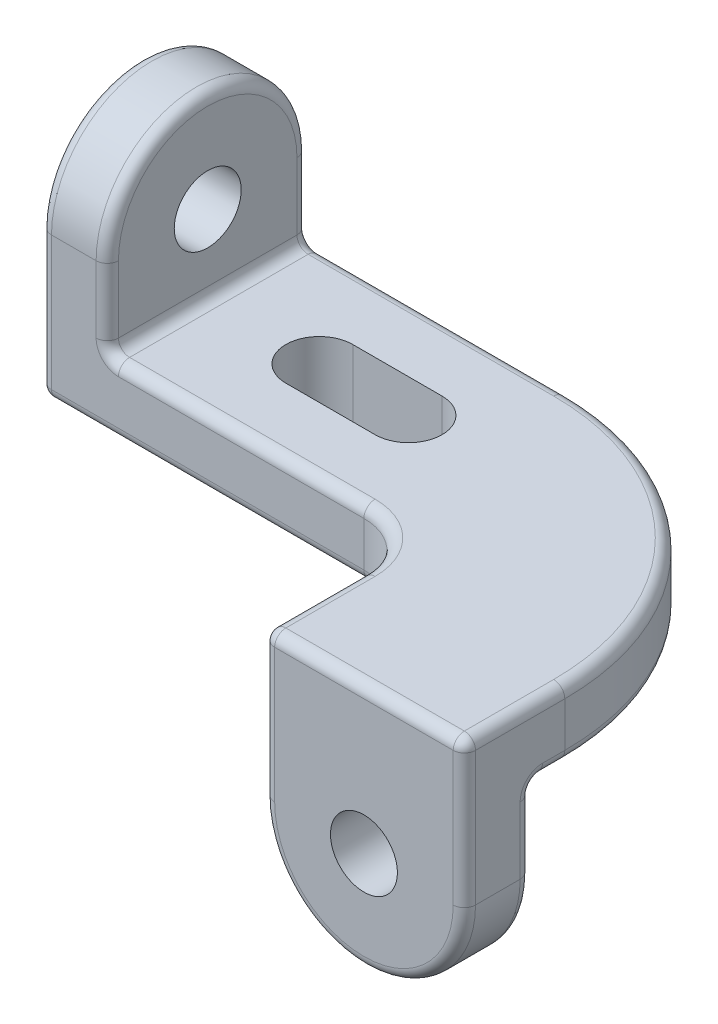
ISO-10303-21;
HEADER;
FILE_DESCRIPTION(('STEP AP214'),'2;1');
FILE_NAME('part.step','',(''),(''),'','','');
FILE_SCHEMA(('AUTOMOTIVE_DESIGN { 1 0 10303 214 1 1 1 1 }'));
ENDSEC;
DATA;
#1=APPLICATION_CONTEXT('core data for automotive mechanical design processes');
#2=APPLICATION_PROTOCOL_DEFINITION('international standard','automotive_design',2000,#1);
#3=PRODUCT_CONTEXT('',#1,'mechanical');
#4=PRODUCT('Part','Part','',(#3));
#5=PRODUCT_RELATED_PRODUCT_CATEGORY('part','',(#4));
#6=PRODUCT_DEFINITION_FORMATION('','',#4);
#7=PRODUCT_DEFINITION_CONTEXT('part definition',#1,'design');
#8=PRODUCT_DEFINITION('design','',#6,#7);
#9=PRODUCT_DEFINITION_SHAPE('','',#8);
#10=(LENGTH_UNIT() NAMED_UNIT(*) SI_UNIT(.MILLI.,.METRE.));
#11=(NAMED_UNIT(*) PLANE_ANGLE_UNIT() SI_UNIT($,.RADIAN.));
#12=(NAMED_UNIT(*) SI_UNIT($,.STERADIAN.) SOLID_ANGLE_UNIT());
#13=UNCERTAINTY_MEASURE_WITH_UNIT(LENGTH_MEASURE(1.E-05),#10,'distance_accuracy_value','');
#14=(GEOMETRIC_REPRESENTATION_CONTEXT(3) GLOBAL_UNCERTAINTY_ASSIGNED_CONTEXT((#13)) GLOBAL_UNIT_ASSIGNED_CONTEXT((#10,
#11,#12)) REPRESENTATION_CONTEXT('',''));
#15=CARTESIAN_POINT('',(0.,0.,0.));
#16=DIRECTION('',(0.,0.,1.));
#17=DIRECTION('',(1.,0.,0.));
#18=AXIS2_PLACEMENT_3D('',#15,#16,#17);
#19=CARTESIAN_POINT('',(19.05,0.,0.));
#20=DIRECTION('',(0.,1.,0.));
#21=DIRECTION('',(0.,0.,1.));
#22=AXIS2_PLACEMENT_3D('',#19,#20,#21);
#23=PLANE('',#22);
#24=DIRECTION('',(-1.,0.,0.));
#25=VECTOR('',#24,1.);
#26=CARTESIAN_POINT('',(19.05,0.,-3.175));
#27=LINE('',#26,#25);
#28=CARTESIAN_POINT('',(92.075,0.,-3.175));
#29=VERTEX_POINT('',#28);
#30=CARTESIAN_POINT('',(3.175,0.,-3.175));
#31=VERTEX_POINT('',#30);
#32=EDGE_CURVE('E379',#29,#31,#27,.T.);
#33=ORIENTED_EDGE('',*,*,#32,.T.);
#34=DIRECTION('',(0.,0.,-1.));
#35=VECTOR('',#34,1.);
#36=CARTESIAN_POINT('',(3.175,0.,0.));
#37=LINE('',#36,#35);
#38=CARTESIAN_POINT('',(3.175,0.,-53.975));
#39=VERTEX_POINT('',#38);
#40=EDGE_CURVE('E382',#31,#39,#37,.T.);
#41=ORIENTED_EDGE('',*,*,#40,.T.);
#42=DIRECTION('',(-1.,0.,0.));
#43=VECTOR('',#42,1.);
#44=CARTESIAN_POINT('',(19.05,0.,-53.975));
#45=LINE('',#44,#43);
#46=CARTESIAN_POINT('',(92.075,0.,-53.975));
#47=VERTEX_POINT('',#46);
#48=EDGE_CURVE('E377',#39,#47,#45,.F.);
#49=ORIENTED_EDGE('',*,*,#48,.T.);
#50=CARTESIAN_POINT('',(92.075,0.,15.875));
#51=DIRECTION('',(0.,1.,0.));
#52=DIRECTION('',(0.,0.,1.));
#53=AXIS2_PLACEMENT_3D('',#50,#51,#52);
#54=CIRCLE('',#53,69.85);
#55=CARTESIAN_POINT('',(161.925,0.,15.875));
#56=VERTEX_POINT('',#55);
#57=EDGE_CURVE('E373',#47,#56,#54,.F.);
#58=ORIENTED_EDGE('',*,*,#57,.T.);
#59=DIRECTION('',(0.,0.,-1.));
#60=VECTOR('',#59,1.);
#61=CARTESIAN_POINT('',(161.925,0.,1.38777878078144E-13));
#62=LINE('',#61,#60);
#63=CARTESIAN_POINT('',(161.925,0.,22.225));
#64=VERTEX_POINT('',#63);
#65=EDGE_CURVE('E369',#56,#64,#62,.F.);
#66=ORIENTED_EDGE('',*,*,#65,.T.);
#67=DIRECTION('',(1.,0.,0.));
#68=VECTOR('',#67,1.);
#69=CARTESIAN_POINT('',(107.95,0.,22.225));
#70=LINE('',#69,#68);
#71=CARTESIAN_POINT('',(111.125,0.,22.225));
#72=VERTEX_POINT('',#71);
#73=EDGE_CURVE('E367',#64,#72,#70,.F.);
#74=ORIENTED_EDGE('',*,*,#73,.T.);
#75=DIRECTION('',(0.,0.,1.));
#76=VECTOR('',#75,1.);
#77=CARTESIAN_POINT('',(111.125,0.,0.));
#78=LINE('',#77,#76);
#79=CARTESIAN_POINT('',(111.125,0.,15.875));
#80=VERTEX_POINT('',#79);
#81=EDGE_CURVE('E371',#72,#80,#78,.F.);
#82=ORIENTED_EDGE('',*,*,#81,.T.);
#83=CARTESIAN_POINT('',(92.075,0.,15.875));
#84=DIRECTION('',(0.,1.,0.));
#85=DIRECTION('',(0.,0.,1.));
#86=AXIS2_PLACEMENT_3D('',#83,#84,#85);
#87=CIRCLE('',#86,19.05);
#88=EDGE_CURVE('E375',#80,#29,#87,.T.);
#89=ORIENTED_EDGE('',*,*,#88,.T.);
#90=EDGE_LOOP('',(#33,#41,#49,#58,#66,#74,#82,#89));
#91=FACE_BOUND('',#90,.T.);
#92=DIRECTION('',(1.,0.,0.));
#93=VECTOR('',#92,1.);
#94=CARTESIAN_POINT('',(50.8,0.,-38.1));
#95=LINE('',#94,#93);
#96=CARTESIAN_POINT('',(50.8,0.,-38.1));
#97=VERTEX_POINT('',#96);
#98=CARTESIAN_POINT('',(76.2,0.,-38.1));
#99=VERTEX_POINT('',#98);
#100=EDGE_CURVE('E261',#97,#99,#95,.T.);
#101=ORIENTED_EDGE('',*,*,#100,.F.);
#102=CARTESIAN_POINT('',(50.8,0.,-28.575));
#103=DIRECTION('',(0.,1.,0.));
#104=DIRECTION('',(0.,0.,1.));
#105=AXIS2_PLACEMENT_3D('',#102,#103,#104);
#106=CIRCLE('',#105,9.525);
#107=CARTESIAN_POINT('',(50.8,0.,-19.05));
#108=VERTEX_POINT('',#107);
#109=EDGE_CURVE('E241',#108,#97,#106,.F.);
#110=ORIENTED_EDGE('',*,*,#109,.F.);
#111=DIRECTION('',(-1.,0.,0.));
#112=VECTOR('',#111,1.);
#113=CARTESIAN_POINT('',(50.8,0.,-19.05));
#114=LINE('',#113,#112);
#115=CARTESIAN_POINT('',(76.2,0.,-19.05));
#116=VERTEX_POINT('',#115);
#117=EDGE_CURVE('E253',#116,#108,#114,.T.);
#118=ORIENTED_EDGE('',*,*,#117,.F.);
#119=CARTESIAN_POINT('',(76.2,0.,-28.575));
#120=DIRECTION('',(0.,1.,0.));
#121=DIRECTION('',(0.,0.,1.));
#122=AXIS2_PLACEMENT_3D('',#119,#120,#121);
#123=CIRCLE('',#122,9.525);
#124=EDGE_CURVE('E265',#99,#116,#123,.F.);
#125=ORIENTED_EDGE('',*,*,#124,.F.);
#126=EDGE_LOOP('',(#101,#110,#118,#125));
#127=FACE_BOUND('',#126,.T.);
#128=ADVANCED_FACE('F14',(#91,#127),#23,.F.);
#129=CARTESIAN_POINT('',(19.05,41.275,0.));
#130=DIRECTION('',(0.,0.,-1.));
#131=DIRECTION('',(0.,1.,0.));
#132=AXIS2_PLACEMENT_3D('',#129,#130,#131);
#133=PLANE('',#132);
#134=CARTESIAN_POINT('',(22.225,22.225,0.));
#135=DIRECTION('',(0.,0.,-1.));
#136=DIRECTION('',(0.,1.,0.));
#137=AXIS2_PLACEMENT_3D('',#134,#135,#136);
#138=CIRCLE('',#137,6.35);
#139=CARTESIAN_POINT('',(15.875,22.225,0.));
#140=VERTEX_POINT('',#139);
#141=CARTESIAN_POINT('',(22.225,15.875,0.));
#142=VERTEX_POINT('',#141);
#143=EDGE_CURVE('E389',#140,#142,#138,.F.);
#144=ORIENTED_EDGE('',*,*,#143,.F.);
#145=DIRECTION('',(0.,-1.,0.));
#146=VECTOR('',#145,1.);
#147=CARTESIAN_POINT('',(15.875,41.275,0.));
#148=LINE('',#147,#146);
#149=CARTESIAN_POINT('',(15.875,41.275,0.));
#150=VERTEX_POINT('',#149);
#151=EDGE_CURVE('E394',#140,#150,#148,.F.);
#152=ORIENTED_EDGE('',*,*,#151,.T.);
#153=DIRECTION('',(-1.,0.,0.));
#154=VECTOR('',#153,1.);
#155=CARTESIAN_POINT('',(19.05,41.275,0.));
#156=LINE('',#155,#154);
#157=CARTESIAN_POINT('',(3.175,41.275,0.));
#158=VERTEX_POINT('',#157);
#159=EDGE_CURVE('E308',#150,#158,#156,.T.);
#160=ORIENTED_EDGE('',*,*,#159,.T.);
#161=DIRECTION('',(0.,-1.,0.));
#162=VECTOR('',#161,1.);
#163=CARTESIAN_POINT('',(3.175,41.275,0.));
#164=LINE('',#163,#162);
#165=CARTESIAN_POINT('',(3.175,3.175,0.));
#166=VERTEX_POINT('',#165);
#167=EDGE_CURVE('E384',#158,#166,#164,.T.);
#168=ORIENTED_EDGE('',*,*,#167,.T.);
#169=DIRECTION('',(-1.,0.,0.));
#170=VECTOR('',#169,1.);
#171=CARTESIAN_POINT('',(19.05,3.175,0.));
#172=LINE('',#171,#170);
#173=CARTESIAN_POINT('',(92.075,3.175,0.));
#174=VERTEX_POINT('',#173);
#175=EDGE_CURVE('E386',#166,#174,#172,.F.);
#176=ORIENTED_EDGE('',*,*,#175,.T.);
#177=DIRECTION('',(0.,-1.,0.));
#178=VECTOR('',#177,1.);
#179=CARTESIAN_POINT('',(92.075,19.05,0.));
#180=LINE('',#179,#178);
#181=CARTESIAN_POINT('',(92.075,15.875,0.));
#182=VERTEX_POINT('',#181);
#183=EDGE_CURVE('E305',#182,#174,#180,.T.);
#184=ORIENTED_EDGE('',*,*,#183,.F.);
#185=DIRECTION('',(1.,0.,0.));
#186=VECTOR('',#185,1.);
#187=CARTESIAN_POINT('',(19.05,15.875,0.));
#188=LINE('',#187,#186);
#189=EDGE_CURVE('E392',#182,#142,#188,.F.);
#190=ORIENTED_EDGE('',*,*,#189,.T.);
#191=EDGE_LOOP('',(#144,#152,#160,#168,#176,#184,#190));
#192=FACE_BOUND('',#191,.T.);
#193=ADVANCED_FACE('F616',(#192),#133,.F.);
#194=CARTESIAN_POINT('',(19.05,0.,-57.15));
#195=DIRECTION('',(0.,0.,1.));
#196=DIRECTION('',(1.,0.,0.));
#197=AXIS2_PLACEMENT_3D('',#194,#195,#196);
#198=PLANE('',#197);
#199=CARTESIAN_POINT('',(22.225,22.225,-57.15));
#200=DIRECTION('',(0.,0.,1.));
#201=DIRECTION('',(1.,0.,0.));
#202=AXIS2_PLACEMENT_3D('',#199,#200,#201);
#203=CIRCLE('',#202,6.35);
#204=CARTESIAN_POINT('',(22.225,15.875,-57.15));
#205=VERTEX_POINT('',#204);
#206=CARTESIAN_POINT('',(15.875,22.225,-57.15));
#207=VERTEX_POINT('',#206);
#208=EDGE_CURVE('E351',#205,#207,#203,.F.);
#209=ORIENTED_EDGE('',*,*,#208,.F.);
#210=DIRECTION('',(-1.,0.,0.));
#211=VECTOR('',#210,1.);
#212=CARTESIAN_POINT('',(92.075,15.875,-57.15));
#213=LINE('',#212,#211);
#214=CARTESIAN_POINT('',(92.075,15.875,-57.15));
#215=VERTEX_POINT('',#214);
#216=EDGE_CURVE('E356',#205,#215,#213,.F.);
#217=ORIENTED_EDGE('',*,*,#216,.T.);
#218=DIRECTION('',(0.,-1.,0.));
#219=VECTOR('',#218,1.);
#220=CARTESIAN_POINT('',(92.075,19.05,-57.15));
#221=LINE('',#220,#219);
#222=CARTESIAN_POINT('',(92.075,3.175,-57.15));
#223=VERTEX_POINT('',#222);
#224=EDGE_CURVE('E294',#215,#223,#221,.T.);
#225=ORIENTED_EDGE('',*,*,#224,.T.);
#226=DIRECTION('',(-1.,0.,0.));
#227=VECTOR('',#226,1.);
#228=CARTESIAN_POINT('',(19.05,3.175,-57.15));
#229=LINE('',#228,#227);
#230=CARTESIAN_POINT('',(3.175,3.175,-57.15));
#231=VERTEX_POINT('',#230);
#232=EDGE_CURVE('E349',#223,#231,#229,.T.);
#233=ORIENTED_EDGE('',*,*,#232,.T.);
#234=DIRECTION('',(0.,1.,0.));
#235=VECTOR('',#234,1.);
#236=CARTESIAN_POINT('',(3.175,0.,-57.15));
#237=LINE('',#236,#235);
#238=CARTESIAN_POINT('',(3.175,41.275,-57.15));
#239=VERTEX_POINT('',#238);
#240=EDGE_CURVE('E347',#231,#239,#237,.T.);
#241=ORIENTED_EDGE('',*,*,#240,.T.);
#242=DIRECTION('',(-1.,0.,0.));
#243=VECTOR('',#242,1.);
#244=CARTESIAN_POINT('',(19.05,41.275,-57.15));
#245=LINE('',#244,#243);
#246=CARTESIAN_POINT('',(15.875,41.275,-57.15));
#247=VERTEX_POINT('',#246);
#248=EDGE_CURVE('E311',#247,#239,#245,.T.);
#249=ORIENTED_EDGE('',*,*,#248,.F.);
#250=DIRECTION('',(0.,1.,0.));
#251=VECTOR('',#250,1.);
#252=CARTESIAN_POINT('',(15.875,19.05,-57.15));
#253=LINE('',#252,#251);
#254=EDGE_CURVE('E354',#247,#207,#253,.F.);
#255=ORIENTED_EDGE('',*,*,#254,.T.);
#256=EDGE_LOOP('',(#209,#217,#225,#233,#241,#249,#255));
#257=FACE_BOUND('',#256,.T.);
#258=ADVANCED_FACE('F643',(#257),#198,.F.);
#259=CARTESIAN_POINT('',(19.05,41.275,-28.575));
#260=DIRECTION('',(-1.,0.,0.));
#261=DIRECTION('',(0.,0.,1.));
#262=AXIS2_PLACEMENT_3D('',#259,#260,#261);
#263=CYLINDRICAL_SURFACE('',#262,28.575);
#264=ORIENTED_EDGE('',*,*,#159,.F.);
#265=CARTESIAN_POINT('',(15.875,41.275,-28.575));
#266=DIRECTION('',(1.,0.,0.));
#267=DIRECTION('',(0.,0.,-1.));
#268=AXIS2_PLACEMENT_3D('',#265,#266,#267);
#269=CIRCLE('',#268,28.575);
#270=EDGE_CURVE('E398',#150,#247,#269,.F.);
#271=ORIENTED_EDGE('',*,*,#270,.T.);
#272=ORIENTED_EDGE('',*,*,#248,.T.);
#273=CARTESIAN_POINT('',(3.175,41.275,-28.575));
#274=DIRECTION('',(1.,0.,0.));
#275=DIRECTION('',(0.,0.,-1.));
#276=AXIS2_PLACEMENT_3D('',#273,#274,#275);
#277=CIRCLE('',#276,28.575);
#278=EDGE_CURVE('E396',#239,#158,#277,.T.);
#279=ORIENTED_EDGE('',*,*,#278,.T.);
#280=EDGE_LOOP('',(#264,#271,#272,#279));
#281=FACE_BOUND('',#280,.T.);
#282=ADVANCED_FACE('F640',(#281),#263,.T.);
#283=CARTESIAN_POINT('',(19.05,41.275,-28.575));
#284=DIRECTION('',(1.,0.,0.));
#285=DIRECTION('',(0.,0.,-1.));
#286=AXIS2_PLACEMENT_3D('',#283,#284,#285);
#287=PLANE('',#286);
#288=DIRECTION('',(0.,0.,1.));
#289=VECTOR('',#288,1.);
#290=CARTESIAN_POINT('',(19.05,22.225,-57.15));
#291=LINE('',#290,#289);
#292=CARTESIAN_POINT('',(19.05,22.225,-3.175));
#293=VERTEX_POINT('',#292);
#294=CARTESIAN_POINT('',(19.05,22.225,-53.975));
#295=VERTEX_POINT('',#294);
#296=EDGE_CURVE('E358',#293,#295,#291,.F.);
#297=ORIENTED_EDGE('',*,*,#296,.T.);
#298=DIRECTION('',(0.,1.,0.));
#299=VECTOR('',#298,1.);
#300=CARTESIAN_POINT('',(19.05,41.275,-53.975));
#301=LINE('',#300,#299);
#302=CARTESIAN_POINT('',(19.05,41.275,-53.975));
#303=VERTEX_POINT('',#302);
#304=EDGE_CURVE('E364',#295,#303,#301,.T.);
#305=ORIENTED_EDGE('',*,*,#304,.T.);
#306=CARTESIAN_POINT('',(19.05,41.275,-28.575));
#307=DIRECTION('',(1.,0.,0.));
#308=DIRECTION('',(0.,0.,-1.));
#309=AXIS2_PLACEMENT_3D('',#306,#307,#308);
#310=CIRCLE('',#309,25.4);
#311=CARTESIAN_POINT('',(19.05,41.275,-3.175));
#312=VERTEX_POINT('',#311);
#313=EDGE_CURVE('E362',#303,#312,#310,.T.);
#314=ORIENTED_EDGE('',*,*,#313,.T.);
#315=DIRECTION('',(0.,-1.,0.));
#316=VECTOR('',#315,1.);
#317=CARTESIAN_POINT('',(19.05,19.05,-3.175));
#318=LINE('',#317,#316);
#319=EDGE_CURVE('E360',#312,#293,#318,.T.);
#320=ORIENTED_EDGE('',*,*,#319,.T.);
#321=EDGE_LOOP('',(#297,#305,#314,#320));
#322=FACE_BOUND('',#321,.T.);
#323=CARTESIAN_POINT('',(19.05,41.275,-28.575));
#324=DIRECTION('',(1.,0.,0.));
#325=DIRECTION('',(0.,0.,-1.));
#326=AXIS2_PLACEMENT_3D('',#323,#324,#325);
#327=CIRCLE('',#326,9.525);
#328=CARTESIAN_POINT('',(19.05,41.275,-38.1));
#329=VERTEX_POINT('',#328);
#330=EDGE_CURVE('E284',#329,#329,#327,.F.);
#331=ORIENTED_EDGE('',*,*,#330,.T.);
#332=EDGE_LOOP('',(#331));
#333=FACE_BOUND('',#332,.T.);
#334=ADVANCED_FACE('F1135',(#322,#333),#287,.T.);
#335=CARTESIAN_POINT('',(0.,41.275,-28.575));
#336=DIRECTION('',(1.,0.,0.));
#337=DIRECTION('',(0.,0.,-1.));
#338=AXIS2_PLACEMENT_3D('',#335,#336,#337);
#339=PLANE('',#338);
#340=CARTESIAN_POINT('',(0.,41.275,-28.575));
#341=DIRECTION('',(1.,0.,0.));
#342=DIRECTION('',(0.,0.,-1.));
#343=AXIS2_PLACEMENT_3D('',#340,#341,#342);
#344=CIRCLE('',#343,25.4);
#345=CARTESIAN_POINT('',(0.,41.275,-3.175));
#346=VERTEX_POINT('',#345);
#347=CARTESIAN_POINT('',(0.,41.275,-53.975));
#348=VERTEX_POINT('',#347);
#349=EDGE_CURVE('E23',#346,#348,#344,.F.);
#350=ORIENTED_EDGE('',*,*,#349,.T.);
#351=DIRECTION('',(0.,1.,0.));
#352=VECTOR('',#351,1.);
#353=CARTESIAN_POINT('',(0.,41.275,-53.975));
#354=LINE('',#353,#352);
#355=CARTESIAN_POINT('',(0.,3.175,-53.975));
#356=VERTEX_POINT('',#355);
#357=EDGE_CURVE('E9',#348,#356,#354,.F.);
#358=ORIENTED_EDGE('',*,*,#357,.T.);
#359=DIRECTION('',(0.,0.,-1.));
#360=VECTOR('',#359,1.);
#361=CARTESIAN_POINT('',(0.,3.175,-28.575));
#362=LINE('',#361,#360);
#363=CARTESIAN_POINT('',(0.,3.175,-3.175));
#364=VERTEX_POINT('',#363);
#365=EDGE_CURVE('E37',#356,#364,#362,.F.);
#366=ORIENTED_EDGE('',*,*,#365,.T.);
#367=DIRECTION('',(0.,-1.,0.));
#368=VECTOR('',#367,1.);
#369=CARTESIAN_POINT('',(0.,41.275,-3.175));
#370=LINE('',#369,#368);
#371=EDGE_CURVE('E437',#364,#346,#370,.F.);
#372=ORIENTED_EDGE('',*,*,#371,.T.);
#373=EDGE_LOOP('',(#350,#358,#366,#372));
#374=FACE_BOUND('',#373,.T.);
#375=CARTESIAN_POINT('',(0.,41.275,-28.575));
#376=DIRECTION('',(-1.,0.,0.));
#377=DIRECTION('',(0.,0.,1.));
#378=AXIS2_PLACEMENT_3D('',#375,#376,#377);
#379=CIRCLE('',#378,9.525);
#380=CARTESIAN_POINT('',(0.,41.275,-19.05));
#381=VERTEX_POINT('',#380);
#382=EDGE_CURVE('E285',#381,#381,#379,.T.);
#383=ORIENTED_EDGE('',*,*,#382,.F.);
#384=EDGE_LOOP('',(#383));
#385=FACE_BOUND('',#384,.T.);
#386=ADVANCED_FACE('F675',(#374,#385),#339,.F.);
#387=CARTESIAN_POINT('',(92.075,19.05,15.875));
#388=DIRECTION('',(0.,-1.,0.));
#389=DIRECTION('',(0.,0.,-1.));
#390=AXIS2_PLACEMENT_3D('',#387,#388,#389);
#391=CYLINDRICAL_SURFACE('',#390,15.875);
#392=ORIENTED_EDGE('',*,*,#183,.T.);
#393=CARTESIAN_POINT('',(92.075,3.175,15.875));
#394=DIRECTION('',(0.,1.,0.));
#395=DIRECTION('',(0.,0.,1.));
#396=AXIS2_PLACEMENT_3D('',#393,#394,#395);
#397=CIRCLE('',#396,15.875);
#398=CARTESIAN_POINT('',(107.95,3.175,15.875));
#399=VERTEX_POINT('',#398);
#400=EDGE_CURVE('E402',#174,#399,#397,.F.);
#401=ORIENTED_EDGE('',*,*,#400,.T.);
#402=DIRECTION('',(0.,-1.,0.));
#403=VECTOR('',#402,1.);
#404=CARTESIAN_POINT('',(107.95,19.05,15.875));
#405=LINE('',#404,#403);
#406=CARTESIAN_POINT('',(107.95,15.875,15.875));
#407=VERTEX_POINT('',#406);
#408=EDGE_CURVE('E302',#407,#399,#405,.T.);
#409=ORIENTED_EDGE('',*,*,#408,.F.);
#410=CARTESIAN_POINT('',(92.075,15.875,15.875));
#411=DIRECTION('',(0.,1.,0.));
#412=DIRECTION('',(0.,0.,1.));
#413=AXIS2_PLACEMENT_3D('',#410,#411,#412);
#414=CIRCLE('',#413,15.875);
#415=EDGE_CURVE('E400',#407,#182,#414,.T.);
#416=ORIENTED_EDGE('',*,*,#415,.T.);
#417=EDGE_LOOP('',(#392,#401,#409,#416));
#418=FACE_BOUND('',#417,.T.);
#419=ADVANCED_FACE('F613',(#418),#391,.F.);
#420=CARTESIAN_POINT('',(107.95,19.05,44.45));
#421=DIRECTION('',(1.,0.,0.));
#422=DIRECTION('',(0.,0.,-1.));
#423=AXIS2_PLACEMENT_3D('',#420,#421,#422);
#424=PLANE('',#423);
#425=ORIENTED_EDGE('',*,*,#408,.T.);
#426=DIRECTION('',(0.,0.,1.));
#427=VECTOR('',#426,1.);
#428=CARTESIAN_POINT('',(107.95,3.175,44.45));
#429=LINE('',#428,#427);
#430=CARTESIAN_POINT('',(107.95,3.175,22.225));
#431=VERTEX_POINT('',#430);
#432=EDGE_CURVE('E413',#399,#431,#429,.T.);
#433=ORIENTED_EDGE('',*,*,#432,.T.);
#434=CARTESIAN_POINT('',(107.95,-3.175,22.225));
#435=DIRECTION('',(1.,0.,0.));
#436=DIRECTION('',(0.,0.,-1.));
#437=AXIS2_PLACEMENT_3D('',#434,#435,#436);
#438=CIRCLE('',#437,6.35);
#439=CARTESIAN_POINT('',(107.95,-3.175,28.575));
#440=VERTEX_POINT('',#439);
#441=EDGE_CURVE('E410',#440,#431,#438,.F.);
#442=ORIENTED_EDGE('',*,*,#441,.F.);
#443=DIRECTION('',(0.,-1.,0.));
#444=VECTOR('',#443,1.);
#445=CARTESIAN_POINT('',(107.95,19.05,28.575));
#446=LINE('',#445,#444);
#447=CARTESIAN_POINT('',(107.95,-22.225,28.575));
#448=VERTEX_POINT('',#447);
#449=EDGE_CURVE('E408',#440,#448,#446,.T.);
#450=ORIENTED_EDGE('',*,*,#449,.T.);
#451=DIRECTION('',(0.,0.,1.));
#452=VECTOR('',#451,1.);
#453=CARTESIAN_POINT('',(107.95,-22.225,25.4));
#454=LINE('',#453,#452);
#455=CARTESIAN_POINT('',(107.95,-22.225,41.275));
#456=VERTEX_POINT('',#455);
#457=EDGE_CURVE('E288',#448,#456,#454,.T.);
#458=ORIENTED_EDGE('',*,*,#457,.T.);
#459=DIRECTION('',(0.,-1.,0.));
#460=VECTOR('',#459,1.);
#461=CARTESIAN_POINT('',(107.95,19.05,41.275));
#462=LINE('',#461,#460);
#463=CARTESIAN_POINT('',(107.95,15.875,41.275));
#464=VERTEX_POINT('',#463);
#465=EDGE_CURVE('E406',#456,#464,#462,.F.);
#466=ORIENTED_EDGE('',*,*,#465,.T.);
#467=DIRECTION('',(0.,0.,1.));
#468=VECTOR('',#467,1.);
#469=CARTESIAN_POINT('',(107.95,15.875,15.875));
#470=LINE('',#469,#468);
#471=EDGE_CURVE('E404',#464,#407,#470,.F.);
#472=ORIENTED_EDGE('',*,*,#471,.T.);
#473=EDGE_LOOP('',(#425,#433,#442,#450,#458,#466,#472));
#474=FACE_BOUND('',#473,.T.);
#475=ADVANCED_FACE('F600',(#474),#424,.F.);
#476=CARTESIAN_POINT('',(165.1,19.05,44.45));
#477=DIRECTION('',(0.,0.,-1.));
#478=DIRECTION('',(-1.,0.,0.));
#479=AXIS2_PLACEMENT_3D('',#476,#477,#478);
#480=PLANE('',#479);
#481=DIRECTION('',(0.,-1.,0.));
#482=VECTOR('',#481,1.);
#483=CARTESIAN_POINT('',(161.925,19.05,44.45));
#484=LINE('',#483,#482);
#485=CARTESIAN_POINT('',(161.925,-22.225,44.45));
#486=VERTEX_POINT('',#485);
#487=CARTESIAN_POINT('',(161.925,15.875,44.45));
#488=VERTEX_POINT('',#487);
#489=EDGE_CURVE('E417',#486,#488,#484,.F.);
#490=ORIENTED_EDGE('',*,*,#489,.T.);
#491=DIRECTION('',(1.,0.,0.));
#492=VECTOR('',#491,1.);
#493=CARTESIAN_POINT('',(107.95,15.875,44.45));
#494=LINE('',#493,#492);
#495=CARTESIAN_POINT('',(111.125,15.875,44.45));
#496=VERTEX_POINT('',#495);
#497=EDGE_CURVE('E422',#488,#496,#494,.F.);
#498=ORIENTED_EDGE('',*,*,#497,.T.);
#499=DIRECTION('',(0.,-1.,0.));
#500=VECTOR('',#499,1.);
#501=CARTESIAN_POINT('',(111.125,19.05,44.45));
#502=LINE('',#501,#500);
#503=CARTESIAN_POINT('',(111.125,-22.225,44.45));
#504=VERTEX_POINT('',#503);
#505=EDGE_CURVE('E419',#496,#504,#502,.T.);
#506=ORIENTED_EDGE('',*,*,#505,.T.);
#507=CARTESIAN_POINT('',(136.525,-22.225,44.45));
#508=DIRECTION('',(0.,0.,-1.));
#509=DIRECTION('',(-1.,0.,0.));
#510=AXIS2_PLACEMENT_3D('',#507,#508,#509);
#511=CIRCLE('',#510,25.4);
#512=EDGE_CURVE('E415',#504,#486,#511,.F.);
#513=ORIENTED_EDGE('',*,*,#512,.T.);
#514=EDGE_LOOP('',(#490,#498,#506,#513));
#515=FACE_BOUND('',#514,.T.);
#516=CARTESIAN_POINT('',(136.525,-22.225,44.45));
#517=DIRECTION('',(0.,0.,1.));
#518=DIRECTION('',(1.,0.,0.));
#519=AXIS2_PLACEMENT_3D('',#516,#517,#518);
#520=CIRCLE('',#519,9.525);
#521=CARTESIAN_POINT('',(146.05,-22.225,44.45));
#522=VERTEX_POINT('',#521);
#523=EDGE_CURVE('E257',#522,#522,#520,.T.);
#524=ORIENTED_EDGE('',*,*,#523,.F.);
#525=EDGE_LOOP('',(#524));
#526=FACE_BOUND('',#525,.T.);
#527=ADVANCED_FACE('F582',(#515,#526),#480,.F.);
#528=CARTESIAN_POINT('',(165.1,19.05,15.875));
#529=DIRECTION('',(-1.,0.,0.));
#530=DIRECTION('',(0.,0.,1.));
#531=AXIS2_PLACEMENT_3D('',#528,#529,#530);
#532=PLANE('',#531);
#533=DIRECTION('',(0.,-1.,0.));
#534=VECTOR('',#533,1.);
#535=CARTESIAN_POINT('',(165.1,19.05,15.875));
#536=LINE('',#535,#534);
#537=CARTESIAN_POINT('',(165.1,15.875,15.875));
#538=VERTEX_POINT('',#537);
#539=CARTESIAN_POINT('',(165.1,3.175,15.875));
#540=VERTEX_POINT('',#539);
#541=EDGE_CURVE('E299',#538,#540,#536,.T.);
#542=ORIENTED_EDGE('',*,*,#541,.F.);
#543=DIRECTION('',(0.,0.,-1.));
#544=VECTOR('',#543,1.);
#545=CARTESIAN_POINT('',(165.1,15.875,44.45));
#546=LINE('',#545,#544);
#547=CARTESIAN_POINT('',(165.1,15.875,41.275));
#548=VERTEX_POINT('',#547);
#549=EDGE_CURVE('E340',#538,#548,#546,.F.);
#550=ORIENTED_EDGE('',*,*,#549,.T.);
#551=DIRECTION('',(0.,-1.,0.));
#552=VECTOR('',#551,1.);
#553=CARTESIAN_POINT('',(165.1,19.05,41.275));
#554=LINE('',#553,#552);
#555=CARTESIAN_POINT('',(165.1,-22.225,41.275));
#556=VERTEX_POINT('',#555);
#557=EDGE_CURVE('E338',#548,#556,#554,.T.);
#558=ORIENTED_EDGE('',*,*,#557,.T.);
#559=DIRECTION('',(0.,0.,1.));
#560=VECTOR('',#559,1.);
#561=CARTESIAN_POINT('',(165.1,-22.225,25.4));
#562=LINE('',#561,#560);
#563=CARTESIAN_POINT('',(165.1,-22.225,28.575));
#564=VERTEX_POINT('',#563);
#565=EDGE_CURVE('E291',#564,#556,#562,.T.);
#566=ORIENTED_EDGE('',*,*,#565,.F.);
#567=DIRECTION('',(0.,1.,0.));
#568=VECTOR('',#567,1.);
#569=CARTESIAN_POINT('',(165.1,19.05,28.575));
#570=LINE('',#569,#568);
#571=CARTESIAN_POINT('',(165.1,-3.175,28.575));
#572=VERTEX_POINT('',#571);
#573=EDGE_CURVE('E334',#564,#572,#570,.T.);
#574=ORIENTED_EDGE('',*,*,#573,.T.);
#575=CARTESIAN_POINT('',(165.1,-3.175,22.225));
#576=DIRECTION('',(-1.,0.,0.));
#577=DIRECTION('',(0.,0.,1.));
#578=AXIS2_PLACEMENT_3D('',#575,#576,#577);
#579=CIRCLE('',#578,6.35);
#580=CARTESIAN_POINT('',(165.1,3.175,22.225));
#581=VERTEX_POINT('',#580);
#582=EDGE_CURVE('E331',#581,#572,#579,.F.);
#583=ORIENTED_EDGE('',*,*,#582,.F.);
#584=DIRECTION('',(0.,0.,-1.));
#585=VECTOR('',#584,1.);
#586=CARTESIAN_POINT('',(165.1,3.175,15.875));
#587=LINE('',#586,#585);
#588=EDGE_CURVE('E336',#581,#540,#587,.T.);
#589=ORIENTED_EDGE('',*,*,#588,.T.);
#590=EDGE_LOOP('',(#542,#550,#558,#566,#574,#583,#589));
#591=FACE_BOUND('',#590,.T.);
#592=ADVANCED_FACE('F565',(#591),#532,.F.);
#593=CARTESIAN_POINT('',(92.075,19.05,15.875));
#594=DIRECTION('',(0.,-1.,0.));
#595=DIRECTION('',(0.,0.,-1.));
#596=AXIS2_PLACEMENT_3D('',#593,#594,#595);
#597=CYLINDRICAL_SURFACE('',#596,73.025);
#598=ORIENTED_EDGE('',*,*,#224,.F.);
#599=CARTESIAN_POINT('',(92.075,15.875,15.875));
#600=DIRECTION('',(0.,1.,0.));
#601=DIRECTION('',(0.,0.,1.));
#602=AXIS2_PLACEMENT_3D('',#599,#600,#601);
#603=CIRCLE('',#602,73.025);
#604=EDGE_CURVE('E345',#215,#538,#603,.F.);
#605=ORIENTED_EDGE('',*,*,#604,.T.);
#606=ORIENTED_EDGE('',*,*,#541,.T.);
#607=CARTESIAN_POINT('',(92.075,3.175,15.875));
#608=DIRECTION('',(0.,1.,0.));
#609=DIRECTION('',(0.,0.,1.));
#610=AXIS2_PLACEMENT_3D('',#607,#608,#609);
#611=CIRCLE('',#610,73.025);
#612=EDGE_CURVE('E343',#540,#223,#611,.T.);
#613=ORIENTED_EDGE('',*,*,#612,.T.);
#614=EDGE_LOOP('',(#598,#605,#606,#613));
#615=FACE_BOUND('',#614,.T.);
#616=ADVANCED_FACE('F1101',(#615),#597,.T.);
#617=CARTESIAN_POINT('',(92.075,19.05,15.875));
#618=DIRECTION('',(0.,1.,0.));
#619=DIRECTION('',(0.,0.,1.));
#620=AXIS2_PLACEMENT_3D('',#617,#618,#619);
#621=PLANE('',#620);
#622=DIRECTION('',(1.,0.,0.));
#623=VECTOR('',#622,1.);
#624=CARTESIAN_POINT('',(92.075,19.05,-3.175));
#625=LINE('',#624,#623);
#626=CARTESIAN_POINT('',(22.225,19.05,-3.175));
#627=VERTEX_POINT('',#626);
#628=CARTESIAN_POINT('',(92.075,19.05,-3.175));
#629=VERTEX_POINT('',#628);
#630=EDGE_CURVE('E316',#627,#629,#625,.T.);
#631=ORIENTED_EDGE('',*,*,#630,.T.);
#632=CARTESIAN_POINT('',(92.075,19.05,15.875));
#633=DIRECTION('',(0.,1.,0.));
#634=DIRECTION('',(0.,0.,1.));
#635=AXIS2_PLACEMENT_3D('',#632,#633,#634);
#636=CIRCLE('',#635,19.05);
#637=CARTESIAN_POINT('',(111.125,19.05,15.875));
#638=VERTEX_POINT('',#637);
#639=EDGE_CURVE('E329',#629,#638,#636,.F.);
#640=ORIENTED_EDGE('',*,*,#639,.T.);
#641=DIRECTION('',(0.,0.,1.));
#642=VECTOR('',#641,1.);
#643=CARTESIAN_POINT('',(111.125,19.05,44.45));
#644=LINE('',#643,#642);
#645=CARTESIAN_POINT('',(111.125,19.05,41.275));
#646=VERTEX_POINT('',#645);
#647=EDGE_CURVE('E327',#638,#646,#644,.T.);
#648=ORIENTED_EDGE('',*,*,#647,.T.);
#649=DIRECTION('',(1.,0.,0.));
#650=VECTOR('',#649,1.);
#651=CARTESIAN_POINT('',(165.1,19.05,41.275));
#652=LINE('',#651,#650);
#653=CARTESIAN_POINT('',(161.925,19.05,41.275));
#654=VERTEX_POINT('',#653);
#655=EDGE_CURVE('E325',#646,#654,#652,.T.);
#656=ORIENTED_EDGE('',*,*,#655,.T.);
#657=DIRECTION('',(0.,0.,-1.));
#658=VECTOR('',#657,1.);
#659=CARTESIAN_POINT('',(161.925,19.05,15.875));
#660=LINE('',#659,#658);
#661=CARTESIAN_POINT('',(161.925,19.05,15.875));
#662=VERTEX_POINT('',#661);
#663=EDGE_CURVE('E322',#654,#662,#660,.T.);
#664=ORIENTED_EDGE('',*,*,#663,.T.);
#665=CARTESIAN_POINT('',(92.075,19.05,15.875));
#666=DIRECTION('',(0.,1.,0.));
#667=DIRECTION('',(0.,0.,1.));
#668=AXIS2_PLACEMENT_3D('',#665,#666,#667);
#669=CIRCLE('',#668,69.85);
#670=CARTESIAN_POINT('',(92.075,19.05,-53.975));
#671=VERTEX_POINT('',#670);
#672=EDGE_CURVE('E320',#662,#671,#669,.T.);
#673=ORIENTED_EDGE('',*,*,#672,.T.);
#674=DIRECTION('',(-1.,0.,0.));
#675=VECTOR('',#674,1.);
#676=CARTESIAN_POINT('',(19.05,19.05,-53.975));
#677=LINE('',#676,#675);
#678=CARTESIAN_POINT('',(22.225,19.05,-53.975));
#679=VERTEX_POINT('',#678);
#680=EDGE_CURVE('E318',#671,#679,#677,.T.);
#681=ORIENTED_EDGE('',*,*,#680,.T.);
#682=DIRECTION('',(0.,0.,1.));
#683=VECTOR('',#682,1.);
#684=CARTESIAN_POINT('',(22.225,19.05,0.));
#685=LINE('',#684,#683);
#686=EDGE_CURVE('E314',#679,#627,#685,.T.);
#687=ORIENTED_EDGE('',*,*,#686,.T.);
#688=EDGE_LOOP('',(#631,#640,#648,#656,#664,#673,#681,#687));
#689=FACE_BOUND('',#688,.T.);
#690=CARTESIAN_POINT('',(50.8,19.05,-28.575));
#691=DIRECTION('',(0.,1.,0.));
#692=DIRECTION('',(0.,0.,1.));
#693=AXIS2_PLACEMENT_3D('',#690,#691,#692);
#694=CIRCLE('',#693,9.525);
#695=CARTESIAN_POINT('',(50.8,19.05,-38.1));
#696=VERTEX_POINT('',#695);
#697=CARTESIAN_POINT('',(50.8,19.05,-19.05));
#698=VERTEX_POINT('',#697);
#699=EDGE_CURVE('E244',#696,#698,#694,.T.);
#700=ORIENTED_EDGE('',*,*,#699,.F.);
#701=DIRECTION('',(-1.,0.,0.));
#702=VECTOR('',#701,1.);
#703=CARTESIAN_POINT('',(50.8,19.05,-38.1));
#704=LINE('',#703,#702);
#705=CARTESIAN_POINT('',(76.2,19.05,-38.1));
#706=VERTEX_POINT('',#705);
#707=EDGE_CURVE('E249',#706,#696,#704,.T.);
#708=ORIENTED_EDGE('',*,*,#707,.F.);
#709=CARTESIAN_POINT('',(76.2,19.05,-28.575));
#710=DIRECTION('',(0.,1.,0.));
#711=DIRECTION('',(0.,0.,1.));
#712=AXIS2_PLACEMENT_3D('',#709,#710,#711);
#713=CIRCLE('',#712,9.525);
#714=CARTESIAN_POINT('',(76.2,19.05,-19.05));
#715=VERTEX_POINT('',#714);
#716=EDGE_CURVE('E270',#715,#706,#713,.T.);
#717=ORIENTED_EDGE('',*,*,#716,.F.);
#718=DIRECTION('',(1.,0.,0.));
#719=VECTOR('',#718,1.);
#720=CARTESIAN_POINT('',(50.8,19.05,-19.05));
#721=LINE('',#720,#719);
#722=EDGE_CURVE('E263',#698,#715,#721,.T.);
#723=ORIENTED_EDGE('',*,*,#722,.F.);
#724=EDGE_LOOP('',(#700,#708,#717,#723));
#725=FACE_BOUND('',#724,.T.);
#726=ADVANCED_FACE('F1089',(#689,#725),#621,.T.);
#727=CARTESIAN_POINT('',(136.525,-22.225,25.4));
#728=DIRECTION('',(0.,0.,1.));
#729=DIRECTION('',(1.,0.,0.));
#730=AXIS2_PLACEMENT_3D('',#727,#728,#729);
#731=PLANE('',#730);
#732=CARTESIAN_POINT('',(136.525,-22.225,25.4));
#733=DIRECTION('',(0.,0.,1.));
#734=DIRECTION('',(1.,0.,0.));
#735=AXIS2_PLACEMENT_3D('',#732,#733,#734);
#736=CIRCLE('',#735,25.4);
#737=CARTESIAN_POINT('',(161.925,-22.225,25.4));
#738=VERTEX_POINT('',#737);
#739=CARTESIAN_POINT('',(111.125,-22.225,25.4));
#740=VERTEX_POINT('',#739);
#741=EDGE_CURVE('E428',#738,#740,#736,.F.);
#742=ORIENTED_EDGE('',*,*,#741,.T.);
#743=DIRECTION('',(0.,-1.,0.));
#744=VECTOR('',#743,1.);
#745=CARTESIAN_POINT('',(111.125,-22.225,25.4));
#746=LINE('',#745,#744);
#747=CARTESIAN_POINT('',(111.125,-3.175,25.4));
#748=VERTEX_POINT('',#747);
#749=EDGE_CURVE('E430',#740,#748,#746,.F.);
#750=ORIENTED_EDGE('',*,*,#749,.T.);
#751=DIRECTION('',(1.,0.,0.));
#752=VECTOR('',#751,1.);
#753=CARTESIAN_POINT('',(165.1,-3.175,25.4));
#754=LINE('',#753,#752);
#755=CARTESIAN_POINT('',(161.925,-3.175,25.4));
#756=VERTEX_POINT('',#755);
#757=EDGE_CURVE('E424',#748,#756,#754,.T.);
#758=ORIENTED_EDGE('',*,*,#757,.T.);
#759=DIRECTION('',(0.,1.,0.));
#760=VECTOR('',#759,1.);
#761=CARTESIAN_POINT('',(161.925,-22.225,25.4));
#762=LINE('',#761,#760);
#763=EDGE_CURVE('E426',#756,#738,#762,.F.);
#764=ORIENTED_EDGE('',*,*,#763,.T.);
#765=EDGE_LOOP('',(#742,#750,#758,#764));
#766=FACE_BOUND('',#765,.T.);
#767=CARTESIAN_POINT('',(136.525,-22.225,25.4));
#768=DIRECTION('',(0.,0.,1.));
#769=DIRECTION('',(1.,0.,0.));
#770=AXIS2_PLACEMENT_3D('',#767,#768,#769);
#771=CIRCLE('',#770,9.525);
#772=CARTESIAN_POINT('',(146.05,-22.225,25.4));
#773=VERTEX_POINT('',#772);
#774=EDGE_CURVE('E281',#773,#773,#771,.F.);
#775=ORIENTED_EDGE('',*,*,#774,.F.);
#776=EDGE_LOOP('',(#775));
#777=FACE_BOUND('',#776,.T.);
#778=ADVANCED_FACE('F1080',(#766,#777),#731,.F.);
#779=CARTESIAN_POINT('',(136.525,-22.225,25.4));
#780=DIRECTION('',(0.,0.,1.));
#781=DIRECTION('',(1.,0.,0.));
#782=AXIS2_PLACEMENT_3D('',#779,#780,#781);
#783=CYLINDRICAL_SURFACE('',#782,28.575);
#784=ORIENTED_EDGE('',*,*,#457,.F.);
#785=CARTESIAN_POINT('',(136.525,-22.225,28.575));
#786=DIRECTION('',(0.,0.,1.));
#787=DIRECTION('',(1.,0.,0.));
#788=AXIS2_PLACEMENT_3D('',#785,#786,#787);
#789=CIRCLE('',#788,28.575);
#790=EDGE_CURVE('E435',#448,#564,#789,.T.);
#791=ORIENTED_EDGE('',*,*,#790,.T.);
#792=ORIENTED_EDGE('',*,*,#565,.T.);
#793=CARTESIAN_POINT('',(136.525,-22.225,41.275));
#794=DIRECTION('',(0.,0.,-1.));
#795=DIRECTION('',(-1.,0.,0.));
#796=AXIS2_PLACEMENT_3D('',#793,#794,#795);
#797=CIRCLE('',#796,28.575);
#798=EDGE_CURVE('E433',#556,#456,#797,.T.);
#799=ORIENTED_EDGE('',*,*,#798,.T.);
#800=EDGE_LOOP('',(#784,#791,#792,#799));
#801=FACE_BOUND('',#800,.T.);
#802=ADVANCED_FACE('F571',(#801),#783,.T.);
#803=CARTESIAN_POINT('',(165.101,41.275,-28.575));
#804=DIRECTION('',(-1.,0.,0.));
#805=DIRECTION('',(0.,0.,1.));
#806=AXIS2_PLACEMENT_3D('',#803,#804,#805);
#807=CYLINDRICAL_SURFACE('',#806,9.525);
#808=ORIENTED_EDGE('',*,*,#330,.F.);
#809=EDGE_LOOP('',(#808));
#810=FACE_BOUND('',#809,.T.);
#811=ORIENTED_EDGE('',*,*,#382,.T.);
#812=EDGE_LOOP('',(#811));
#813=FACE_BOUND('',#812,.T.);
#814=ADVANCED_FACE('F1060',(#810,#813),#807,.F.);
#815=CARTESIAN_POINT('',(136.525,-22.225,-57.151));
#816=DIRECTION('',(0.,0.,1.));
#817=DIRECTION('',(1.,0.,0.));
#818=AXIS2_PLACEMENT_3D('',#815,#816,#817);
#819=CYLINDRICAL_SURFACE('',#818,9.525);
#820=ORIENTED_EDGE('',*,*,#523,.T.);
#821=EDGE_LOOP('',(#820));
#822=FACE_BOUND('',#821,.T.);
#823=ORIENTED_EDGE('',*,*,#774,.T.);
#824=EDGE_LOOP('',(#823));
#825=FACE_BOUND('',#824,.T.);
#826=ADVANCED_FACE('F1050',(#822,#825),#819,.F.);
#827=CARTESIAN_POINT('',(50.8,-50.801,-28.575));
#828=DIRECTION('',(0.,1.,0.));
#829=DIRECTION('',(0.,0.,1.));
#830=AXIS2_PLACEMENT_3D('',#827,#828,#829);
#831=CYLINDRICAL_SURFACE('',#830,9.525);
#832=ORIENTED_EDGE('',*,*,#109,.T.);
#833=DIRECTION('',(0.,1.,0.));
#834=VECTOR('',#833,1.);
#835=CARTESIAN_POINT('',(50.8,-50.801,-38.1));
#836=LINE('',#835,#834);
#837=EDGE_CURVE('E258',#97,#696,#836,.T.);
#838=ORIENTED_EDGE('',*,*,#837,.T.);
#839=ORIENTED_EDGE('',*,*,#699,.T.);
#840=DIRECTION('',(0.,1.,0.));
#841=VECTOR('',#840,1.);
#842=CARTESIAN_POINT('',(50.8,-50.801,-19.05));
#843=LINE('',#842,#841);
#844=EDGE_CURVE('E237',#108,#698,#843,.T.);
#845=ORIENTED_EDGE('',*,*,#844,.F.);
#846=EDGE_LOOP('',(#832,#838,#839,#845));
#847=FACE_BOUND('',#846,.T.);
#848=ADVANCED_FACE('F239',(#847),#831,.F.);
#849=CARTESIAN_POINT('',(50.8,-50.801,-38.1));
#850=DIRECTION('',(0.,0.,-1.));
#851=DIRECTION('',(-1.,0.,0.));
#852=AXIS2_PLACEMENT_3D('',#849,#850,#851);
#853=PLANE('',#852);
#854=ORIENTED_EDGE('',*,*,#100,.T.);
#855=DIRECTION('',(0.,1.,0.));
#856=VECTOR('',#855,1.);
#857=CARTESIAN_POINT('',(76.2,-50.801,-38.1));
#858=LINE('',#857,#856);
#859=EDGE_CURVE('E276',#99,#706,#858,.T.);
#860=ORIENTED_EDGE('',*,*,#859,.T.);
#861=ORIENTED_EDGE('',*,*,#707,.T.);
#862=ORIENTED_EDGE('',*,*,#837,.F.);
#863=EDGE_LOOP('',(#854,#860,#861,#862));
#864=FACE_BOUND('',#863,.T.);
#865=ADVANCED_FACE('F1029',(#864),#853,.F.);
#866=CARTESIAN_POINT('',(76.2,-50.801,-28.575));
#867=DIRECTION('',(0.,1.,0.));
#868=DIRECTION('',(0.,0.,1.));
#869=AXIS2_PLACEMENT_3D('',#866,#867,#868);
#870=CYLINDRICAL_SURFACE('',#869,9.525);
#871=ORIENTED_EDGE('',*,*,#124,.T.);
#872=DIRECTION('',(0.,1.,0.));
#873=VECTOR('',#872,1.);
#874=CARTESIAN_POINT('',(76.2,-50.801,-19.05));
#875=LINE('',#874,#873);
#876=EDGE_CURVE('E248',#116,#715,#875,.T.);
#877=ORIENTED_EDGE('',*,*,#876,.T.);
#878=ORIENTED_EDGE('',*,*,#716,.T.);
#879=ORIENTED_EDGE('',*,*,#859,.F.);
#880=EDGE_LOOP('',(#871,#877,#878,#879));
#881=FACE_BOUND('',#880,.T.);
#882=ADVANCED_FACE('F1019',(#881),#870,.F.);
#883=CARTESIAN_POINT('',(50.8,-50.801,-19.05));
#884=DIRECTION('',(0.,0.,1.));
#885=DIRECTION('',(1.,0.,0.));
#886=AXIS2_PLACEMENT_3D('',#883,#884,#885);
#887=PLANE('',#886);
#888=ORIENTED_EDGE('',*,*,#117,.T.);
#889=ORIENTED_EDGE('',*,*,#844,.T.);
#890=ORIENTED_EDGE('',*,*,#722,.T.);
#891=ORIENTED_EDGE('',*,*,#876,.F.);
#892=EDGE_LOOP('',(#888,#889,#890,#891));
#893=FACE_BOUND('',#892,.T.);
#894=ADVANCED_FACE('F254',(#893),#887,.F.);
#895=CARTESIAN_POINT('',(92.075,15.875,-3.175));
#896=DIRECTION('',(-1.,0.,0.));
#897=DIRECTION('',(0.,0.,1.));
#898=AXIS2_PLACEMENT_3D('',#895,#896,#897);
#899=CYLINDRICAL_SURFACE('',#898,3.175);
#900=CARTESIAN_POINT('',(22.225,15.875,-3.175));
#901=DIRECTION('',(-1.,0.,0.));
#902=DIRECTION('',(0.,0.,1.));
#903=AXIS2_PLACEMENT_3D('',#900,#901,#902);
#904=CIRCLE('',#903,3.175);
#905=EDGE_CURVE('E492',#142,#627,#904,.T.);
#906=ORIENTED_EDGE('',*,*,#905,.F.);
#907=ORIENTED_EDGE('',*,*,#189,.F.);
#908=CARTESIAN_POINT('',(92.075,15.875,-3.175));
#909=DIRECTION('',(1.,0.,0.));
#910=DIRECTION('',(0.,0.,-1.));
#911=AXIS2_PLACEMENT_3D('',#908,#909,#910);
#912=CIRCLE('',#911,3.175);
#913=EDGE_CURVE('E495',#629,#182,#912,.T.);
#914=ORIENTED_EDGE('',*,*,#913,.F.);
#915=ORIENTED_EDGE('',*,*,#630,.F.);
#916=EDGE_LOOP('',(#906,#907,#914,#915));
#917=FACE_BOUND('',#916,.T.);
#918=ADVANCED_FACE('F620',(#917),#899,.T.);
#919=CARTESIAN_POINT('',(15.875,41.275,-3.175));
#920=DIRECTION('',(0.,1.,0.));
#921=DIRECTION('',(0.,0.,1.));
#922=AXIS2_PLACEMENT_3D('',#919,#920,#921);
#923=CYLINDRICAL_SURFACE('',#922,3.175);
#924=CARTESIAN_POINT('',(15.875,41.275,-3.175));
#925=DIRECTION('',(0.,1.,0.));
#926=DIRECTION('',(0.,0.,1.));
#927=AXIS2_PLACEMENT_3D('',#924,#925,#926);
#928=CIRCLE('',#927,3.175);
#929=EDGE_CURVE('E486',#150,#312,#928,.T.);
#930=ORIENTED_EDGE('',*,*,#929,.F.);
#931=ORIENTED_EDGE('',*,*,#151,.F.);
#932=CARTESIAN_POINT('',(15.875,22.225,-3.175));
#933=DIRECTION('',(0.,-1.,0.));
#934=DIRECTION('',(0.,0.,-1.));
#935=AXIS2_PLACEMENT_3D('',#932,#933,#934);
#936=CIRCLE('',#935,3.175);
#937=EDGE_CURVE('E489',#293,#140,#936,.T.);
#938=ORIENTED_EDGE('',*,*,#937,.F.);
#939=ORIENTED_EDGE('',*,*,#319,.F.);
#940=EDGE_LOOP('',(#930,#931,#938,#939));
#941=FACE_BOUND('',#940,.T.);
#942=ADVANCED_FACE('F630',(#941),#923,.T.);
#943=CARTESIAN_POINT('',(92.075,15.875,15.875));
#944=DIRECTION('',(0.,1.,0.));
#945=DIRECTION('',(0.,0.,1.));
#946=AXIS2_PLACEMENT_3D('',#943,#944,#945);
#947=TOROIDAL_SURFACE('',#946,19.05,3.175);
#948=ORIENTED_EDGE('',*,*,#913,.T.);
#949=ORIENTED_EDGE('',*,*,#415,.F.);
#950=CARTESIAN_POINT('',(111.125,15.875,15.875));
#951=DIRECTION('',(0.,0.,1.));
#952=DIRECTION('',(1.,0.,0.));
#953=AXIS2_PLACEMENT_3D('',#950,#951,#952);
#954=CIRCLE('',#953,3.175);
#955=EDGE_CURVE('E483',#638,#407,#954,.T.);
#956=ORIENTED_EDGE('',*,*,#955,.F.);
#957=ORIENTED_EDGE('',*,*,#639,.F.);
#958=EDGE_LOOP('',(#948,#949,#956,#957));
#959=FACE_BOUND('',#958,.T.);
#960=ADVANCED_FACE('F609',(#959),#947,.T.);
#961=CARTESIAN_POINT('',(22.225,22.225,-3.175));
#962=DIRECTION('',(0.,0.,-1.));
#963=DIRECTION('',(0.,1.,0.));
#964=AXIS2_PLACEMENT_3D('',#961,#962,#963);
#965=TOROIDAL_SURFACE('',#964,6.35,3.175);
#966=ORIENTED_EDGE('',*,*,#143,.T.);
#967=ORIENTED_EDGE('',*,*,#905,.T.);
#968=CARTESIAN_POINT('',(22.225,22.225,-3.175));
#969=DIRECTION('',(0.,0.,-1.));
#970=DIRECTION('',(0.,1.,0.));
#971=AXIS2_PLACEMENT_3D('',#968,#969,#970);
#972=CIRCLE('',#971,3.175);
#973=EDGE_CURVE('E480',#293,#627,#972,.F.);
#974=ORIENTED_EDGE('',*,*,#973,.F.);
#975=ORIENTED_EDGE('',*,*,#937,.T.);
#976=EDGE_LOOP('',(#966,#967,#974,#975));
#977=FACE_BOUND('',#976,.T.);
#978=ADVANCED_FACE('F624',(#977),#965,.T.);
#979=CARTESIAN_POINT('',(15.875,41.275,-28.575));
#980=DIRECTION('',(1.,0.,0.));
#981=DIRECTION('',(0.,0.,-1.));
#982=AXIS2_PLACEMENT_3D('',#979,#980,#981);
#983=TOROIDAL_SURFACE('',#982,25.4,3.175);
#984=ORIENTED_EDGE('',*,*,#929,.T.);
#985=ORIENTED_EDGE('',*,*,#313,.F.);
#986=CARTESIAN_POINT('',(15.875,41.275,-53.975));
#987=DIRECTION('',(0.,-1.,0.));
#988=DIRECTION('',(0.,0.,-1.));
#989=AXIS2_PLACEMENT_3D('',#986,#987,#988);
#990=CIRCLE('',#989,3.175);
#991=EDGE_CURVE('E478',#247,#303,#990,.T.);
#992=ORIENTED_EDGE('',*,*,#991,.F.);
#993=ORIENTED_EDGE('',*,*,#270,.F.);
#994=EDGE_LOOP('',(#984,#985,#992,#993));
#995=FACE_BOUND('',#994,.T.);
#996=ADVANCED_FACE('F636',(#995),#983,.T.);
#997=CARTESIAN_POINT('',(111.125,19.05,41.275));
#998=DIRECTION('',(0.,-1.,0.));
#999=DIRECTION('',(0.,0.,-1.));
#1000=AXIS2_PLACEMENT_3D('',#997,#998,#999);
#1001=CYLINDRICAL_SURFACE('',#1000,3.175);
#1002=CARTESIAN_POINT('',(111.125,15.875,41.275));
#1003=DIRECTION('',(0.,1.,0.));
#1004=DIRECTION('',(0.,0.,1.));
#1005=AXIS2_PLACEMENT_3D('',#1002,#1003,#1004);
#1006=CIRCLE('',#1005,3.175);
#1007=EDGE_CURVE('E472',#464,#496,#1006,.T.);
#1008=ORIENTED_EDGE('',*,*,#1007,.F.);
#1009=ORIENTED_EDGE('',*,*,#465,.F.);
#1010=CARTESIAN_POINT('',(111.125,-22.225,41.275));
#1011=DIRECTION('',(0.,-1.,0.));
#1012=DIRECTION('',(0.,0.,-1.));
#1013=AXIS2_PLACEMENT_3D('',#1010,#1011,#1012);
#1014=CIRCLE('',#1013,3.175);
#1015=EDGE_CURVE('E475',#504,#456,#1014,.T.);
#1016=ORIENTED_EDGE('',*,*,#1015,.F.);
#1017=ORIENTED_EDGE('',*,*,#505,.F.);
#1018=EDGE_LOOP('',(#1008,#1009,#1016,#1017));
#1019=FACE_BOUND('',#1018,.T.);
#1020=ADVANCED_FACE('F597',(#1019),#1001,.T.);
#1021=CARTESIAN_POINT('',(111.125,15.875,15.875));
#1022=DIRECTION('',(0.,0.,-1.));
#1023=DIRECTION('',(-1.,0.,0.));
#1024=AXIS2_PLACEMENT_3D('',#1021,#1022,#1023);
#1025=CYLINDRICAL_SURFACE('',#1024,3.175);
#1026=ORIENTED_EDGE('',*,*,#955,.T.);
#1027=ORIENTED_EDGE('',*,*,#471,.F.);
#1028=CARTESIAN_POINT('',(111.125,15.875,41.275));
#1029=DIRECTION('',(0.,0.,1.));
#1030=DIRECTION('',(1.,0.,0.));
#1031=AXIS2_PLACEMENT_3D('',#1028,#1029,#1030);
#1032=CIRCLE('',#1031,3.175);
#1033=EDGE_CURVE('E469',#646,#464,#1032,.T.);
#1034=ORIENTED_EDGE('',*,*,#1033,.F.);
#1035=ORIENTED_EDGE('',*,*,#647,.F.);
#1036=EDGE_LOOP('',(#1026,#1027,#1034,#1035));
#1037=FACE_BOUND('',#1036,.T.);
#1038=ADVANCED_FACE('F603',(#1037),#1025,.T.);
#1039=CARTESIAN_POINT('',(22.225,22.225,15.875));
#1040=DIRECTION('',(0.,0.,-1.));
#1041=DIRECTION('',(-1.,0.,0.));
#1042=AXIS2_PLACEMENT_3D('',#1039,#1040,#1041);
#1043=CYLINDRICAL_SURFACE('',#1042,3.175);
#1044=ORIENTED_EDGE('',*,*,#973,.T.);
#1045=ORIENTED_EDGE('',*,*,#686,.F.);
#1046=CARTESIAN_POINT('',(22.225,22.225,-53.975));
#1047=DIRECTION('',(0.,0.,1.));
#1048=DIRECTION('',(1.,0.,0.));
#1049=AXIS2_PLACEMENT_3D('',#1046,#1047,#1048);
#1050=CIRCLE('',#1049,3.175);
#1051=EDGE_CURVE('E466',#295,#679,#1050,.T.);
#1052=ORIENTED_EDGE('',*,*,#1051,.F.);
#1053=ORIENTED_EDGE('',*,*,#296,.F.);
#1054=EDGE_LOOP('',(#1044,#1045,#1052,#1053));
#1055=FACE_BOUND('',#1054,.T.);
#1056=ADVANCED_FACE('F733',(#1055),#1043,.F.);
#1057=CARTESIAN_POINT('',(15.875,41.275,-53.975));
#1058=DIRECTION('',(0.,-1.,0.));
#1059=DIRECTION('',(0.,0.,-1.));
#1060=AXIS2_PLACEMENT_3D('',#1057,#1058,#1059);
#1061=CYLINDRICAL_SURFACE('',#1060,3.175);
#1062=ORIENTED_EDGE('',*,*,#991,.T.);
#1063=ORIENTED_EDGE('',*,*,#304,.F.);
#1064=CARTESIAN_POINT('',(15.875,22.225,-53.975));
#1065=DIRECTION('',(0.,-1.,0.));
#1066=DIRECTION('',(0.,0.,-1.));
#1067=AXIS2_PLACEMENT_3D('',#1064,#1065,#1066);
#1068=CIRCLE('',#1067,3.175);
#1069=EDGE_CURVE('E463',#207,#295,#1068,.T.);
#1070=ORIENTED_EDGE('',*,*,#1069,.F.);
#1071=ORIENTED_EDGE('',*,*,#254,.F.);
#1072=EDGE_LOOP('',(#1062,#1063,#1070,#1071));
#1073=FACE_BOUND('',#1072,.T.);
#1074=ADVANCED_FACE('F730',(#1073),#1061,.T.);
#1075=CARTESIAN_POINT('',(136.525,-22.225,41.275));
#1076=DIRECTION('',(0.,0.,-1.));
#1077=DIRECTION('',(-1.,0.,0.));
#1078=AXIS2_PLACEMENT_3D('',#1075,#1076,#1077);
#1079=TOROIDAL_SURFACE('',#1078,25.4,3.175);
#1080=ORIENTED_EDGE('',*,*,#1015,.T.);
#1081=ORIENTED_EDGE('',*,*,#798,.F.);
#1082=CARTESIAN_POINT('',(161.925,-22.225,41.275));
#1083=DIRECTION('',(0.,1.,0.));
#1084=DIRECTION('',(0.,0.,1.));
#1085=AXIS2_PLACEMENT_3D('',#1082,#1083,#1084);
#1086=CIRCLE('',#1085,3.175);
#1087=EDGE_CURVE('E460',#486,#556,#1086,.T.);
#1088=ORIENTED_EDGE('',*,*,#1087,.F.);
#1089=ORIENTED_EDGE('',*,*,#512,.F.);
#1090=EDGE_LOOP('',(#1080,#1081,#1088,#1089));
#1091=FACE_BOUND('',#1090,.T.);
#1092=ADVANCED_FACE('F574',(#1091),#1079,.T.);
#1093=CARTESIAN_POINT('',(111.125,15.875,41.275));
#1094=DIRECTION('',(0.,0.,1.));
#1095=DIRECTION('',(1.,0.,0.));
#1096=AXIS2_PLACEMENT_3D('',#1093,#1094,#1095);
#1097=SPHERICAL_SURFACE('',#1096,3.175);
#1098=ORIENTED_EDGE('',*,*,#1033,.T.);
#1099=ORIENTED_EDGE('',*,*,#1007,.T.);
#1100=CARTESIAN_POINT('',(111.125,15.875,41.275));
#1101=DIRECTION('',(-1.,0.,0.));
#1102=DIRECTION('',(0.,0.,1.));
#1103=AXIS2_PLACEMENT_3D('',#1100,#1101,#1102);
#1104=CIRCLE('',#1103,3.175);
#1105=EDGE_CURVE('E457',#646,#496,#1104,.F.);
#1106=ORIENTED_EDGE('',*,*,#1105,.F.);
#1107=EDGE_LOOP('',(#1098,#1099,#1106));
#1108=FACE_BOUND('',#1107,.T.);
#1109=ADVANCED_FACE('F592',(#1108),#1097,.T.);
#1110=CARTESIAN_POINT('',(22.225,22.225,-53.975));
#1111=DIRECTION('',(0.,0.,1.));
#1112=DIRECTION('',(1.,0.,0.));
#1113=AXIS2_PLACEMENT_3D('',#1110,#1111,#1112);
#1114=TOROIDAL_SURFACE('',#1113,6.35,3.175);
#1115=ORIENTED_EDGE('',*,*,#1069,.T.);
#1116=ORIENTED_EDGE('',*,*,#1051,.T.);
#1117=CARTESIAN_POINT('',(22.225,15.875,-53.975));
#1118=DIRECTION('',(-1.,0.,0.));
#1119=DIRECTION('',(0.,0.,1.));
#1120=AXIS2_PLACEMENT_3D('',#1117,#1118,#1119);
#1121=CIRCLE('',#1120,3.175);
#1122=EDGE_CURVE('E454',#205,#679,#1121,.F.);
#1123=ORIENTED_EDGE('',*,*,#1122,.F.);
#1124=ORIENTED_EDGE('',*,*,#208,.T.);
#1125=EDGE_LOOP('',(#1115,#1116,#1123,#1124));
#1126=FACE_BOUND('',#1125,.T.);
#1127=ADVANCED_FACE('F722',(#1126),#1114,.T.);
#1128=CARTESIAN_POINT('',(161.925,19.05,41.275));
#1129=DIRECTION('',(0.,-1.,0.));
#1130=DIRECTION('',(0.,0.,-1.));
#1131=AXIS2_PLACEMENT_3D('',#1128,#1129,#1130);
#1132=CYLINDRICAL_SURFACE('',#1131,3.175);
#1133=ORIENTED_EDGE('',*,*,#1087,.T.);
#1134=ORIENTED_EDGE('',*,*,#557,.F.);
#1135=CARTESIAN_POINT('',(161.925,15.875,41.275));
#1136=DIRECTION('',(0.,1.,0.));
#1137=DIRECTION('',(0.,0.,1.));
#1138=AXIS2_PLACEMENT_3D('',#1135,#1136,#1137);
#1139=CIRCLE('',#1138,3.175);
#1140=EDGE_CURVE('E451',#488,#548,#1139,.T.);
#1141=ORIENTED_EDGE('',*,*,#1140,.F.);
#1142=ORIENTED_EDGE('',*,*,#489,.F.);
#1143=EDGE_LOOP('',(#1133,#1134,#1141,#1142));
#1144=FACE_BOUND('',#1143,.T.);
#1145=ADVANCED_FACE('F578',(#1144),#1132,.T.);
#1146=CARTESIAN_POINT('',(92.075,15.875,41.275));
#1147=DIRECTION('',(-1.,0.,0.));
#1148=DIRECTION('',(0.,0.,1.));
#1149=AXIS2_PLACEMENT_3D('',#1146,#1147,#1148);
#1150=CYLINDRICAL_SURFACE('',#1149,3.175);
#1151=ORIENTED_EDGE('',*,*,#1105,.T.);
#1152=ORIENTED_EDGE('',*,*,#497,.F.);
#1153=CARTESIAN_POINT('',(161.925,15.875,41.275));
#1154=DIRECTION('',(1.,0.,0.));
#1155=DIRECTION('',(0.,0.,-1.));
#1156=AXIS2_PLACEMENT_3D('',#1153,#1154,#1155);
#1157=CIRCLE('',#1156,3.175);
#1158=EDGE_CURVE('E448',#654,#488,#1157,.T.);
#1159=ORIENTED_EDGE('',*,*,#1158,.F.);
#1160=ORIENTED_EDGE('',*,*,#655,.F.);
#1161=EDGE_LOOP('',(#1151,#1152,#1159,#1160));
#1162=FACE_BOUND('',#1161,.T.);
#1163=ADVANCED_FACE('F587',(#1162),#1150,.T.);
#1164=CARTESIAN_POINT('',(92.075,15.875,-53.975));
#1165=DIRECTION('',(1.,0.,0.));
#1166=DIRECTION('',(0.,0.,-1.));
#1167=AXIS2_PLACEMENT_3D('',#1164,#1165,#1166);
#1168=CYLINDRICAL_SURFACE('',#1167,3.175);
#1169=ORIENTED_EDGE('',*,*,#1122,.T.);
#1170=ORIENTED_EDGE('',*,*,#680,.F.);
#1171=CARTESIAN_POINT('',(92.075,15.875,-53.975));
#1172=DIRECTION('',(1.,0.,0.));
#1173=DIRECTION('',(0.,0.,-1.));
#1174=AXIS2_PLACEMENT_3D('',#1171,#1172,#1173);
#1175=CIRCLE('',#1174,3.175);
#1176=EDGE_CURVE('E445',#215,#671,#1175,.T.);
#1177=ORIENTED_EDGE('',*,*,#1176,.F.);
#1178=ORIENTED_EDGE('',*,*,#216,.F.);
#1179=EDGE_LOOP('',(#1169,#1170,#1177,#1178));
#1180=FACE_BOUND('',#1179,.T.);
#1181=ADVANCED_FACE('F713',(#1180),#1168,.T.);
#1182=CARTESIAN_POINT('',(161.925,15.875,41.275));
#1183=DIRECTION('',(0.,0.,1.));
#1184=DIRECTION('',(1.,0.,0.));
#1185=AXIS2_PLACEMENT_3D('',#1182,#1183,#1184);
#1186=SPHERICAL_SURFACE('',#1185,3.175);
#1187=ORIENTED_EDGE('',*,*,#1158,.T.);
#1188=ORIENTED_EDGE('',*,*,#1140,.T.);
#1189=CARTESIAN_POINT('',(161.925,15.875,41.275));
#1190=DIRECTION('',(0.,0.,1.));
#1191=DIRECTION('',(0.,-1.,0.));
#1192=AXIS2_PLACEMENT_3D('',#1189,#1190,#1191);
#1193=CIRCLE('',#1192,3.175);
#1194=EDGE_CURVE('E443',#654,#548,#1193,.F.);
#1195=ORIENTED_EDGE('',*,*,#1194,.F.);
#1196=EDGE_LOOP('',(#1187,#1188,#1195));
#1197=FACE_BOUND('',#1196,.T.);
#1198=ADVANCED_FACE('F709',(#1197),#1186,.T.);
#1199=CARTESIAN_POINT('',(92.075,15.875,15.875));
#1200=DIRECTION('',(0.,1.,0.));
#1201=DIRECTION('',(0.,0.,1.));
#1202=AXIS2_PLACEMENT_3D('',#1199,#1200,#1201);
#1203=TOROIDAL_SURFACE('',#1202,69.85,3.175);
#1204=ORIENTED_EDGE('',*,*,#1176,.T.);
#1205=ORIENTED_EDGE('',*,*,#672,.F.);
#1206=CARTESIAN_POINT('',(161.925,15.875,15.875));
#1207=DIRECTION('',(0.,0.,1.));
#1208=DIRECTION('',(0.,-1.,0.));
#1209=AXIS2_PLACEMENT_3D('',#1206,#1207,#1208);
#1210=CIRCLE('',#1209,3.175);
#1211=EDGE_CURVE('E441',#538,#662,#1210,.T.);
#1212=ORIENTED_EDGE('',*,*,#1211,.F.);
#1213=ORIENTED_EDGE('',*,*,#604,.F.);
#1214=EDGE_LOOP('',(#1204,#1205,#1212,#1213));
#1215=FACE_BOUND('',#1214,.T.);
#1216=ADVANCED_FACE('F705',(#1215),#1203,.T.);
#1217=CARTESIAN_POINT('',(161.925,15.875,15.875));
#1218=DIRECTION('',(0.,0.,1.));
#1219=DIRECTION('',(1.,0.,0.));
#1220=AXIS2_PLACEMENT_3D('',#1217,#1218,#1219);
#1221=CYLINDRICAL_SURFACE('',#1220,3.175);
#1222=ORIENTED_EDGE('',*,*,#1194,.T.);
#1223=ORIENTED_EDGE('',*,*,#549,.F.);
#1224=ORIENTED_EDGE('',*,*,#1211,.T.);
#1225=ORIENTED_EDGE('',*,*,#663,.F.);
#1226=EDGE_LOOP('',(#1222,#1223,#1224,#1225));
#1227=FACE_BOUND('',#1226,.T.);
#1228=ADVANCED_FACE('F702',(#1227),#1221,.T.);
#1229=CARTESIAN_POINT('',(161.925,19.05,28.575));
#1230=DIRECTION('',(0.,1.,0.));
#1231=DIRECTION('',(0.,0.,1.));
#1232=AXIS2_PLACEMENT_3D('',#1229,#1230,#1231);
#1233=CYLINDRICAL_SURFACE('',#1232,3.175);
#1234=CARTESIAN_POINT('',(161.925,-3.175,28.575));
#1235=DIRECTION('',(0.,1.,0.));
#1236=DIRECTION('',(0.,0.,1.));
#1237=AXIS2_PLACEMENT_3D('',#1234,#1235,#1236);
#1238=CIRCLE('',#1237,3.175);
#1239=EDGE_CURVE('E547',#572,#756,#1238,.T.);
#1240=ORIENTED_EDGE('',*,*,#1239,.F.);
#1241=ORIENTED_EDGE('',*,*,#573,.F.);
#1242=CARTESIAN_POINT('',(161.925,-22.225,28.575));
#1243=DIRECTION('',(0.,-1.,0.));
#1244=DIRECTION('',(0.,0.,-1.));
#1245=AXIS2_PLACEMENT_3D('',#1242,#1243,#1244);
#1246=CIRCLE('',#1245,3.175);
#1247=EDGE_CURVE('E18',#738,#564,#1246,.T.);
#1248=ORIENTED_EDGE('',*,*,#1247,.F.);
#1249=ORIENTED_EDGE('',*,*,#763,.F.);
#1250=EDGE_LOOP('',(#1240,#1241,#1248,#1249));
#1251=FACE_BOUND('',#1250,.T.);
#1252=ADVANCED_FACE('F16',(#1251),#1233,.T.);
#1253=CARTESIAN_POINT('',(161.925,3.175,15.875));
#1254=DIRECTION('',(0.,0.,-1.));
#1255=DIRECTION('',(-1.,0.,0.));
#1256=AXIS2_PLACEMENT_3D('',#1253,#1254,#1255);
#1257=CYLINDRICAL_SURFACE('',#1256,3.175);
#1258=CARTESIAN_POINT('',(161.925,3.175,15.875));
#1259=DIRECTION('',(0.,0.,-1.));
#1260=DIRECTION('',(0.,1.,0.));
#1261=AXIS2_PLACEMENT_3D('',#1258,#1259,#1260);
#1262=CIRCLE('',#1261,3.175);
#1263=EDGE_CURVE('E542',#540,#56,#1262,.T.);
#1264=ORIENTED_EDGE('',*,*,#1263,.F.);
#1265=ORIENTED_EDGE('',*,*,#588,.F.);
#1266=CARTESIAN_POINT('',(161.925,3.175,22.225));
#1267=DIRECTION('',(0.,0.,1.));
#1268=DIRECTION('',(1.,0.,0.));
#1269=AXIS2_PLACEMENT_3D('',#1266,#1267,#1268);
#1270=CIRCLE('',#1269,3.175);
#1271=EDGE_CURVE('E545',#64,#581,#1270,.T.);
#1272=ORIENTED_EDGE('',*,*,#1271,.F.);
#1273=ORIENTED_EDGE('',*,*,#65,.F.);
#1274=EDGE_LOOP('',(#1264,#1265,#1272,#1273));
#1275=FACE_BOUND('',#1274,.T.);
#1276=ADVANCED_FACE('F1000',(#1275),#1257,.T.);
#1277=CARTESIAN_POINT('',(136.525,-22.225,28.575));
#1278=DIRECTION('',(0.,0.,1.));
#1279=DIRECTION('',(1.,0.,0.));
#1280=AXIS2_PLACEMENT_3D('',#1277,#1278,#1279);
#1281=TOROIDAL_SURFACE('',#1280,25.4,3.175);
#1282=ORIENTED_EDGE('',*,*,#1247,.T.);
#1283=ORIENTED_EDGE('',*,*,#790,.F.);
#1284=CARTESIAN_POINT('',(111.125,-22.225,28.575));
#1285=DIRECTION('',(0.,1.,0.));
#1286=DIRECTION('',(0.,0.,1.));
#1287=AXIS2_PLACEMENT_3D('',#1284,#1285,#1286);
#1288=CIRCLE('',#1287,3.175);
#1289=EDGE_CURVE('E539',#740,#448,#1288,.T.);
#1290=ORIENTED_EDGE('',*,*,#1289,.F.);
#1291=ORIENTED_EDGE('',*,*,#741,.F.);
#1292=EDGE_LOOP('',(#1282,#1283,#1290,#1291));
#1293=FACE_BOUND('',#1292,.T.);
#1294=ADVANCED_FACE('F557',(#1293),#1281,.T.);
#1295=CARTESIAN_POINT('',(161.925,-3.175,22.225));
#1296=DIRECTION('',(-1.,0.,0.));
#1297=DIRECTION('',(0.,0.,1.));
#1298=AXIS2_PLACEMENT_3D('',#1295,#1296,#1297);
#1299=TOROIDAL_SURFACE('',#1298,6.35,3.175);
#1300=ORIENTED_EDGE('',*,*,#582,.T.);
#1301=ORIENTED_EDGE('',*,*,#1239,.T.);
#1302=CARTESIAN_POINT('',(161.925,-3.175,22.225));
#1303=DIRECTION('',(-1.,0.,0.));
#1304=DIRECTION('',(0.,0.,1.));
#1305=AXIS2_PLACEMENT_3D('',#1302,#1303,#1304);
#1306=CIRCLE('',#1305,3.175);
#1307=EDGE_CURVE('E536',#64,#756,#1306,.F.);
#1308=ORIENTED_EDGE('',*,*,#1307,.F.);
#1309=ORIENTED_EDGE('',*,*,#1271,.T.);
#1310=EDGE_LOOP('',(#1300,#1301,#1308,#1309));
#1311=FACE_BOUND('',#1310,.T.);
#1312=ADVANCED_FACE('F984',(#1311),#1299,.T.);
#1313=CARTESIAN_POINT('',(92.075,3.175,15.875));
#1314=DIRECTION('',(0.,1.,0.));
#1315=DIRECTION('',(0.,0.,1.));
#1316=AXIS2_PLACEMENT_3D('',#1313,#1314,#1315);
#1317=TOROIDAL_SURFACE('',#1316,69.85,3.175);
#1318=ORIENTED_EDGE('',*,*,#1263,.T.);
#1319=ORIENTED_EDGE('',*,*,#57,.F.);
#1320=CARTESIAN_POINT('',(92.075,3.175,-53.975));
#1321=DIRECTION('',(-1.,0.,0.));
#1322=DIRECTION('',(0.,0.,1.));
#1323=AXIS2_PLACEMENT_3D('',#1320,#1321,#1322);
#1324=CIRCLE('',#1323,3.175);
#1325=EDGE_CURVE('E533',#223,#47,#1324,.T.);
#1326=ORIENTED_EDGE('',*,*,#1325,.F.);
#1327=ORIENTED_EDGE('',*,*,#612,.F.);
#1328=EDGE_LOOP('',(#1318,#1319,#1326,#1327));
#1329=FACE_BOUND('',#1328,.T.);
#1330=ADVANCED_FACE('F975',(#1329),#1317,.T.);
#1331=CARTESIAN_POINT('',(111.125,19.05,28.575));
#1332=DIRECTION('',(0.,-1.,0.));
#1333=DIRECTION('',(0.,0.,-1.));
#1334=AXIS2_PLACEMENT_3D('',#1331,#1332,#1333);
#1335=CYLINDRICAL_SURFACE('',#1334,3.175);
#1336=ORIENTED_EDGE('',*,*,#1289,.T.);
#1337=ORIENTED_EDGE('',*,*,#449,.F.);
#1338=CARTESIAN_POINT('',(111.125,-3.175,28.575));
#1339=DIRECTION('',(0.,1.,0.));
#1340=DIRECTION('',(0.,0.,1.));
#1341=AXIS2_PLACEMENT_3D('',#1338,#1339,#1340);
#1342=CIRCLE('',#1341,3.175);
#1343=EDGE_CURVE('E530',#748,#440,#1342,.T.);
#1344=ORIENTED_EDGE('',*,*,#1343,.F.);
#1345=ORIENTED_EDGE('',*,*,#749,.F.);
#1346=EDGE_LOOP('',(#1336,#1337,#1344,#1345));
#1347=FACE_BOUND('',#1346,.T.);
#1348=ADVANCED_FACE('F966',(#1347),#1335,.T.);
#1349=CARTESIAN_POINT('',(136.525,-3.175,22.225));
#1350=DIRECTION('',(-1.,0.,0.));
#1351=DIRECTION('',(0.,0.,1.));
#1352=AXIS2_PLACEMENT_3D('',#1349,#1350,#1351);
#1353=CYLINDRICAL_SURFACE('',#1352,3.175);
#1354=ORIENTED_EDGE('',*,*,#1307,.T.);
#1355=ORIENTED_EDGE('',*,*,#757,.F.);
#1356=CARTESIAN_POINT('',(111.125,-3.175,22.225));
#1357=DIRECTION('',(1.,0.,0.));
#1358=DIRECTION('',(0.,0.,-1.));
#1359=AXIS2_PLACEMENT_3D('',#1356,#1357,#1358);
#1360=CIRCLE('',#1359,3.175);
#1361=EDGE_CURVE('E528',#72,#748,#1360,.T.);
#1362=ORIENTED_EDGE('',*,*,#1361,.F.);
#1363=ORIENTED_EDGE('',*,*,#73,.F.);
#1364=EDGE_LOOP('',(#1354,#1355,#1362,#1363));
#1365=FACE_BOUND('',#1364,.T.);
#1366=ADVANCED_FACE('F958',(#1365),#1353,.F.);
#1367=CARTESIAN_POINT('',(19.05,3.175,-53.975));
#1368=DIRECTION('',(-1.,0.,0.));
#1369=DIRECTION('',(0.,0.,1.));
#1370=AXIS2_PLACEMENT_3D('',#1367,#1368,#1369);
#1371=CYLINDRICAL_SURFACE('',#1370,3.175);
#1372=ORIENTED_EDGE('',*,*,#1325,.T.);
#1373=ORIENTED_EDGE('',*,*,#48,.F.);
#1374=CARTESIAN_POINT('',(3.175,3.175,-53.975));
#1375=DIRECTION('',(-1.,0.,0.));
#1376=DIRECTION('',(0.,0.,1.));
#1377=AXIS2_PLACEMENT_3D('',#1374,#1375,#1376);
#1378=CIRCLE('',#1377,3.175);
#1379=EDGE_CURVE('E525',#231,#39,#1378,.T.);
#1380=ORIENTED_EDGE('',*,*,#1379,.F.);
#1381=ORIENTED_EDGE('',*,*,#232,.F.);
#1382=EDGE_LOOP('',(#1372,#1373,#1380,#1381));
#1383=FACE_BOUND('',#1382,.T.);
#1384=ADVANCED_FACE('F654',(#1383),#1371,.T.);
#1385=CARTESIAN_POINT('',(3.175,0.,-53.975));
#1386=DIRECTION('',(0.,1.,0.));
#1387=DIRECTION('',(0.,0.,1.));
#1388=AXIS2_PLACEMENT_3D('',#1385,#1386,#1387);
#1389=CYLINDRICAL_SURFACE('',#1388,3.175);
#1390=CARTESIAN_POINT('',(3.175,41.275,-53.975));
#1391=DIRECTION('',(0.,1.,0.));
#1392=DIRECTION('',(0.,0.,1.));
#1393=AXIS2_PLACEMENT_3D('',#1390,#1391,#1392);
#1394=CIRCLE('',#1393,3.175);
#1395=EDGE_CURVE('E519',#239,#348,#1394,.T.);
#1396=ORIENTED_EDGE('',*,*,#1395,.F.);
#1397=ORIENTED_EDGE('',*,*,#240,.F.);
#1398=CARTESIAN_POINT('',(3.175,3.175,-53.975));
#1399=DIRECTION('',(0.,-1.,0.));
#1400=DIRECTION('',(0.,0.,-1.));
#1401=AXIS2_PLACEMENT_3D('',#1398,#1399,#1400);
#1402=CIRCLE('',#1401,3.175);
#1403=EDGE_CURVE('E522',#356,#231,#1402,.T.);
#1404=ORIENTED_EDGE('',*,*,#1403,.F.);
#1405=ORIENTED_EDGE('',*,*,#357,.F.);
#1406=EDGE_LOOP('',(#1396,#1397,#1404,#1405));
#1407=FACE_BOUND('',#1406,.T.);
#1408=ADVANCED_FACE('F650',(#1407),#1389,.T.);
#1409=CARTESIAN_POINT('',(111.125,-3.175,22.225));
#1410=DIRECTION('',(1.,0.,0.));
#1411=DIRECTION('',(0.,0.,-1.));
#1412=AXIS2_PLACEMENT_3D('',#1409,#1410,#1411);
#1413=TOROIDAL_SURFACE('',#1412,6.35,3.175);
#1414=ORIENTED_EDGE('',*,*,#1343,.T.);
#1415=ORIENTED_EDGE('',*,*,#441,.T.);
#1416=CARTESIAN_POINT('',(111.125,3.175,22.225));
#1417=DIRECTION('',(0.,0.,1.));
#1418=DIRECTION('',(1.,0.,0.));
#1419=AXIS2_PLACEMENT_3D('',#1416,#1417,#1418);
#1420=CIRCLE('',#1419,3.175);
#1421=EDGE_CURVE('E516',#72,#431,#1420,.F.);
#1422=ORIENTED_EDGE('',*,*,#1421,.F.);
#1423=ORIENTED_EDGE('',*,*,#1361,.T.);
#1424=EDGE_LOOP('',(#1414,#1415,#1422,#1423));
#1425=FACE_BOUND('',#1424,.T.);
#1426=ADVANCED_FACE('F690',(#1425),#1413,.T.);
#1427=CARTESIAN_POINT('',(3.175,3.175,-53.975));
#1428=DIRECTION('',(0.,0.,1.));
#1429=DIRECTION('',(1.,0.,0.));
#1430=AXIS2_PLACEMENT_3D('',#1427,#1428,#1429);
#1431=SPHERICAL_SURFACE('',#1430,3.175);
#1432=ORIENTED_EDGE('',*,*,#1403,.T.);
#1433=ORIENTED_EDGE('',*,*,#1379,.T.);
#1434=CARTESIAN_POINT('',(3.175,3.175,-53.975));
#1435=DIRECTION('',(0.,0.,-1.));
#1436=DIRECTION('',(-1.,0.,0.));
#1437=AXIS2_PLACEMENT_3D('',#1434,#1435,#1436);
#1438=CIRCLE('',#1437,3.175);
#1439=EDGE_CURVE('E514',#356,#39,#1438,.F.);
#1440=ORIENTED_EDGE('',*,*,#1439,.F.);
#1441=EDGE_LOOP('',(#1432,#1433,#1440));
#1442=FACE_BOUND('',#1441,.T.);
#1443=ADVANCED_FACE('F656',(#1442),#1431,.T.);
#1444=CARTESIAN_POINT('',(3.175,41.275,-28.575));
#1445=DIRECTION('',(1.,0.,0.));
#1446=DIRECTION('',(0.,0.,-1.));
#1447=AXIS2_PLACEMENT_3D('',#1444,#1445,#1446);
#1448=TOROIDAL_SURFACE('',#1447,25.4,3.175);
#1449=ORIENTED_EDGE('',*,*,#1395,.T.);
#1450=ORIENTED_EDGE('',*,*,#349,.F.);
#1451=CARTESIAN_POINT('',(3.175,41.275,-3.175));
#1452=DIRECTION('',(0.,-1.,0.));
#1453=DIRECTION('',(0.,0.,-1.));
#1454=AXIS2_PLACEMENT_3D('',#1451,#1452,#1453);
#1455=CIRCLE('',#1454,3.175);
#1456=EDGE_CURVE('E511',#158,#346,#1455,.T.);
#1457=ORIENTED_EDGE('',*,*,#1456,.F.);
#1458=ORIENTED_EDGE('',*,*,#278,.F.);
#1459=EDGE_LOOP('',(#1449,#1450,#1457,#1458));
#1460=FACE_BOUND('',#1459,.T.);
#1461=ADVANCED_FACE('F678',(#1460),#1448,.T.);
#1462=CARTESIAN_POINT('',(111.125,3.175,44.45));
#1463=DIRECTION('',(0.,0.,1.));
#1464=DIRECTION('',(1.,0.,0.));
#1465=AXIS2_PLACEMENT_3D('',#1462,#1463,#1464);
#1466=CYLINDRICAL_SURFACE('',#1465,3.175);
#1467=ORIENTED_EDGE('',*,*,#1421,.T.);
#1468=ORIENTED_EDGE('',*,*,#432,.F.);
#1469=CARTESIAN_POINT('',(111.125,3.175,15.875));
#1470=DIRECTION('',(0.,0.,-1.));
#1471=DIRECTION('',(-1.,0.,0.));
#1472=AXIS2_PLACEMENT_3D('',#1469,#1470,#1471);
#1473=CIRCLE('',#1472,3.175);
#1474=EDGE_CURVE('E508',#80,#399,#1473,.T.);
#1475=ORIENTED_EDGE('',*,*,#1474,.F.);
#1476=ORIENTED_EDGE('',*,*,#81,.F.);
#1477=EDGE_LOOP('',(#1467,#1468,#1475,#1476));
#1478=FACE_BOUND('',#1477,.T.);
#1479=ADVANCED_FACE('F680',(#1478),#1466,.T.);
#1480=CARTESIAN_POINT('',(3.175,3.175,0.));
#1481=DIRECTION('',(0.,0.,-1.));
#1482=DIRECTION('',(-1.,0.,0.));
#1483=AXIS2_PLACEMENT_3D('',#1480,#1481,#1482);
#1484=CYLINDRICAL_SURFACE('',#1483,3.175);
#1485=ORIENTED_EDGE('',*,*,#1439,.T.);
#1486=ORIENTED_EDGE('',*,*,#40,.F.);
#1487=CARTESIAN_POINT('',(3.175,3.175,-3.175));
#1488=DIRECTION('',(0.,0.,1.));
#1489=DIRECTION('',(1.,0.,0.));
#1490=AXIS2_PLACEMENT_3D('',#1487,#1488,#1489);
#1491=CIRCLE('',#1490,3.175);
#1492=EDGE_CURVE('E505',#364,#31,#1491,.T.);
#1493=ORIENTED_EDGE('',*,*,#1492,.F.);
#1494=ORIENTED_EDGE('',*,*,#365,.F.);
#1495=EDGE_LOOP('',(#1485,#1486,#1493,#1494));
#1496=FACE_BOUND('',#1495,.T.);
#1497=ADVANCED_FACE('F658',(#1496),#1484,.T.);
#1498=CARTESIAN_POINT('',(3.175,41.275,-3.175));
#1499=DIRECTION('',(0.,-1.,0.));
#1500=DIRECTION('',(0.,0.,-1.));
#1501=AXIS2_PLACEMENT_3D('',#1498,#1499,#1500);
#1502=CYLINDRICAL_SURFACE('',#1501,3.175);
#1503=ORIENTED_EDGE('',*,*,#1456,.T.);
#1504=ORIENTED_EDGE('',*,*,#371,.F.);
#1505=CARTESIAN_POINT('',(3.175,3.175,-3.175));
#1506=DIRECTION('',(0.,-1.,0.));
#1507=DIRECTION('',(0.,0.,-1.));
#1508=AXIS2_PLACEMENT_3D('',#1505,#1506,#1507);
#1509=CIRCLE('',#1508,3.175);
#1510=EDGE_CURVE('E502',#166,#364,#1509,.T.);
#1511=ORIENTED_EDGE('',*,*,#1510,.F.);
#1512=ORIENTED_EDGE('',*,*,#167,.F.);
#1513=EDGE_LOOP('',(#1503,#1504,#1511,#1512));
#1514=FACE_BOUND('',#1513,.T.);
#1515=ADVANCED_FACE('F673',(#1514),#1502,.T.);
#1516=CARTESIAN_POINT('',(92.075,3.175,15.875));
#1517=DIRECTION('',(0.,1.,0.));
#1518=DIRECTION('',(0.,0.,1.));
#1519=AXIS2_PLACEMENT_3D('',#1516,#1517,#1518);
#1520=TOROIDAL_SURFACE('',#1519,19.05,3.175);
#1521=ORIENTED_EDGE('',*,*,#1474,.T.);
#1522=ORIENTED_EDGE('',*,*,#400,.F.);
#1523=CARTESIAN_POINT('',(92.075,3.175,-3.175));
#1524=DIRECTION('',(-1.,0.,0.));
#1525=DIRECTION('',(0.,0.,1.));
#1526=AXIS2_PLACEMENT_3D('',#1523,#1524,#1525);
#1527=CIRCLE('',#1526,3.175);
#1528=EDGE_CURVE('E500',#29,#174,#1527,.T.);
#1529=ORIENTED_EDGE('',*,*,#1528,.F.);
#1530=ORIENTED_EDGE('',*,*,#88,.F.);
#1531=EDGE_LOOP('',(#1521,#1522,#1529,#1530));
#1532=FACE_BOUND('',#1531,.T.);
#1533=ADVANCED_FACE('F756',(#1532),#1520,.T.);
#1534=CARTESIAN_POINT('',(3.175,3.175,-3.175));
#1535=DIRECTION('',(0.,0.,1.));
#1536=DIRECTION('',(1.,0.,0.));
#1537=AXIS2_PLACEMENT_3D('',#1534,#1535,#1536);
#1538=SPHERICAL_SURFACE('',#1537,3.175);
#1539=ORIENTED_EDGE('',*,*,#1510,.T.);
#1540=ORIENTED_EDGE('',*,*,#1492,.T.);
#1541=CARTESIAN_POINT('',(3.175,3.175,-3.175));
#1542=DIRECTION('',(-1.,0.,0.));
#1543=DIRECTION('',(0.,0.,1.));
#1544=AXIS2_PLACEMENT_3D('',#1541,#1542,#1543);
#1545=CIRCLE('',#1544,3.175);
#1546=EDGE_CURVE('E498',#166,#31,#1545,.F.);
#1547=ORIENTED_EDGE('',*,*,#1546,.F.);
#1548=EDGE_LOOP('',(#1539,#1540,#1547));
#1549=FACE_BOUND('',#1548,.T.);
#1550=ADVANCED_FACE('F668',(#1549),#1538,.T.);
#1551=CARTESIAN_POINT('',(19.05,3.175,-3.175));
#1552=DIRECTION('',(-1.,0.,0.));
#1553=DIRECTION('',(0.,0.,1.));
#1554=AXIS2_PLACEMENT_3D('',#1551,#1552,#1553);
#1555=CYLINDRICAL_SURFACE('',#1554,3.175);
#1556=ORIENTED_EDGE('',*,*,#1528,.T.);
#1557=ORIENTED_EDGE('',*,*,#175,.F.);
#1558=ORIENTED_EDGE('',*,*,#1546,.T.);
#1559=ORIENTED_EDGE('',*,*,#32,.F.);
#1560=EDGE_LOOP('',(#1556,#1557,#1558,#1559));
#1561=FACE_BOUND('',#1560,.T.);
#1562=ADVANCED_FACE('F664',(#1561),#1555,.T.);
#1563=CLOSED_SHELL('',(#128,#193,#258,#282,#334,#386,#419,#475,#527,#592,#616,#726,#778,#802,
#814,#826,#848,#865,#882,#894,#918,#942,#960,#978,#996,#1020,#1038,#1056,#1074,#1092,#1109,
#1127,#1145,#1163,#1181,#1198,#1216,#1228,#1252,#1276,#1294,#1312,#1330,#1348,#1366,#1384,#1408,
#1426,#1443,#1461,#1479,#1497,#1515,#1533,#1550,#1562));
#1564=MANIFOLD_SOLID_BREP('B1',#1563);
#1565=ADVANCED_BREP_SHAPE_REPRESENTATION('',(#18,#1564),#14);
#1566=SHAPE_DEFINITION_REPRESENTATION(#9,#1565);
ENDSEC;
END-ISO-10303-21;
